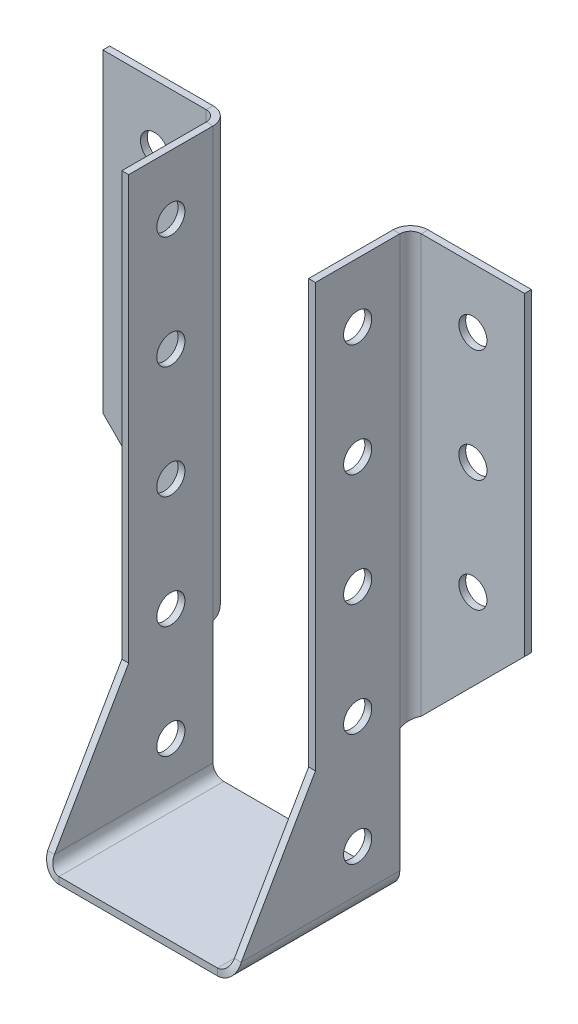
ISO-10303-21;
HEADER;
FILE_DESCRIPTION(('STEP AP214'),'2;1');
FILE_NAME('part.step','',(''),(''),'','','');
FILE_SCHEMA(('AUTOMOTIVE_DESIGN { 1 0 10303 214 1 1 1 1 }'));
ENDSEC;
DATA;
#1=APPLICATION_CONTEXT('core data for automotive mechanical design processes');
#2=APPLICATION_PROTOCOL_DEFINITION('international standard','automotive_design',2000,#1);
#3=PRODUCT_CONTEXT('',#1,'mechanical');
#4=PRODUCT('Part','Part','',(#3));
#5=PRODUCT_RELATED_PRODUCT_CATEGORY('part','',(#4));
#6=PRODUCT_DEFINITION_FORMATION('','',#4);
#7=PRODUCT_DEFINITION_CONTEXT('part definition',#1,'design');
#8=PRODUCT_DEFINITION('design','',#6,#7);
#9=PRODUCT_DEFINITION_SHAPE('','',#8);
#10=(LENGTH_UNIT() NAMED_UNIT(*) SI_UNIT(.MILLI.,.METRE.));
#11=(NAMED_UNIT(*) PLANE_ANGLE_UNIT() SI_UNIT($,.RADIAN.));
#12=(NAMED_UNIT(*) SI_UNIT($,.STERADIAN.) SOLID_ANGLE_UNIT());
#13=UNCERTAINTY_MEASURE_WITH_UNIT(LENGTH_MEASURE(1.E-05),#10,'distance_accuracy_value','');
#14=(GEOMETRIC_REPRESENTATION_CONTEXT(3) GLOBAL_UNCERTAINTY_ASSIGNED_CONTEXT((#13)) GLOBAL_UNIT_ASSIGNED_CONTEXT((#10,
#11,#12)) REPRESENTATION_CONTEXT('',''));
#15=CARTESIAN_POINT('',(0.,0.,0.));
#16=DIRECTION('',(0.,0.,1.));
#17=DIRECTION('',(1.,0.,0.));
#18=AXIS2_PLACEMENT_3D('',#15,#16,#17);
#19=CARTESIAN_POINT('',(-16.,100.,30.));
#20=DIRECTION('',(-1.,0.,0.));
#21=DIRECTION('',(0.,0.,1.));
#22=AXIS2_PLACEMENT_3D('',#19,#20,#21);
#23=PLANE('',#22);
#24=CARTESIAN_POINT('',(-16.,49.39294,7.49999999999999));
#25=DIRECTION('',(-1.,0.,0.));
#26=DIRECTION('',(0.,0.,1.));
#27=AXIS2_PLACEMENT_3D('',#24,#25,#26);
#28=CIRCLE('',#27,2.49999999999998);
#29=CARTESIAN_POINT('',(-16.,49.39294,9.99999999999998));
#30=VERTEX_POINT('',#29);
#31=EDGE_CURVE('E1303',#30,#30,#28,.T.);
#32=ORIENTED_EDGE('',*,*,#31,.T.);
#33=EDGE_LOOP('',(#32));
#34=FACE_BOUND('',#33,.T.);
#35=CARTESIAN_POINT('',(-16.,89.39294,7.5));
#36=DIRECTION('',(-1.,0.,0.));
#37=DIRECTION('',(0.,0.,1.));
#38=AXIS2_PLACEMENT_3D('',#35,#36,#37);
#39=CIRCLE('',#38,2.49999999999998);
#40=CARTESIAN_POINT('',(-16.,89.39294,9.99999999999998));
#41=VERTEX_POINT('',#40);
#42=EDGE_CURVE('E1291',#41,#41,#39,.T.);
#43=ORIENTED_EDGE('',*,*,#42,.T.);
#44=EDGE_LOOP('',(#43));
#45=FACE_BOUND('',#44,.T.);
#46=CARTESIAN_POINT('',(-16.,69.39294,7.5));
#47=DIRECTION('',(-1.,0.,0.));
#48=DIRECTION('',(0.,0.,1.));
#49=AXIS2_PLACEMENT_3D('',#46,#47,#48);
#50=CIRCLE('',#49,2.49999999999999);
#51=CARTESIAN_POINT('',(-16.,69.39294,9.99999999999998));
#52=VERTEX_POINT('',#51);
#53=EDGE_CURVE('E306',#52,#52,#50,.T.);
#54=ORIENTED_EDGE('',*,*,#53,.T.);
#55=EDGE_LOOP('',(#54));
#56=FACE_BOUND('',#55,.T.);
#57=CARTESIAN_POINT('',(-16.,9.39294,7.5));
#58=DIRECTION('',(-1.,0.,0.));
#59=DIRECTION('',(0.,0.,1.));
#60=AXIS2_PLACEMENT_3D('',#57,#58,#59);
#61=CIRCLE('',#60,2.49999999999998);
#62=CARTESIAN_POINT('',(-16.,9.39294,9.99999999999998));
#63=VERTEX_POINT('',#62);
#64=EDGE_CURVE('E303',#63,#63,#61,.T.);
#65=ORIENTED_EDGE('',*,*,#64,.T.);
#66=EDGE_LOOP('',(#65));
#67=FACE_BOUND('',#66,.T.);
#68=CARTESIAN_POINT('',(-16.,29.39294,7.5));
#69=DIRECTION('',(-1.,0.,0.));
#70=DIRECTION('',(0.,0.,1.));
#71=AXIS2_PLACEMENT_3D('',#68,#69,#70);
#72=CIRCLE('',#71,2.49999999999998);
#73=CARTESIAN_POINT('',(-16.,29.39294,9.99999999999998));
#74=VERTEX_POINT('',#73);
#75=EDGE_CURVE('E321',#74,#74,#72,.T.);
#76=ORIENTED_EDGE('',*,*,#75,.T.);
#77=EDGE_LOOP('',(#76));
#78=FACE_BOUND('',#77,.T.);
#79=DIRECTION('',(0.,-0.866025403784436,0.500000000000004));
#80=VECTOR('',#79,1.);
#81=CARTESIAN_POINT('',(-16.,74.6964699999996,-13.8269995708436));
#82=LINE('',#81,#80);
#83=CARTESIAN_POINT('',(-16.,24.7666421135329,15.));
#84=VERTEX_POINT('',#83);
#85=CARTESIAN_POINT('',(-16.,1.905,28.1991752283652));
#86=VERTEX_POINT('',#85);
#87=EDGE_CURVE('E358',#84,#86,#82,.T.);
#88=ORIENTED_EDGE('',*,*,#87,.T.);
#89=DIRECTION('',(0.,0.,-1.));
#90=VECTOR('',#89,1.);
#91=CARTESIAN_POINT('',(-16.,1.905,30.));
#92=LINE('',#91,#90);
#93=CARTESIAN_POINT('',(-16.,1.905,0.));
#94=VERTEX_POINT('',#93);
#95=EDGE_CURVE('E525',#86,#94,#92,.T.);
#96=ORIENTED_EDGE('',*,*,#95,.T.);
#97=DIRECTION('',(0.,1.,0.));
#98=VECTOR('',#97,1.);
#99=CARTESIAN_POINT('',(-16.,100.,0.));
#100=LINE('',#99,#98);
#101=CARTESIAN_POINT('',(-16.,23.78588,0.));
#102=VERTEX_POINT('',#101);
#103=EDGE_CURVE('E497',#94,#102,#100,.T.);
#104=ORIENTED_EDGE('',*,*,#103,.T.);
#105=DIRECTION('',(0.,-1.,0.));
#106=VECTOR('',#105,1.);
#107=CARTESIAN_POINT('',(-16.,23.78588,0.));
#108=LINE('',#107,#106);
#109=CARTESIAN_POINT('',(-16.,100.,0.));
#110=VERTEX_POINT('',#109);
#111=EDGE_CURVE('E400',#102,#110,#108,.F.);
#112=ORIENTED_EDGE('',*,*,#111,.T.);
#113=DIRECTION('',(0.,0.,-1.));
#114=VECTOR('',#113,1.);
#115=CARTESIAN_POINT('',(-16.,100.,30.));
#116=LINE('',#115,#114);
#117=CARTESIAN_POINT('',(-16.,100.,15.));
#118=VERTEX_POINT('',#117);
#119=EDGE_CURVE('E277',#118,#110,#116,.T.);
#120=ORIENTED_EDGE('',*,*,#119,.F.);
#121=DIRECTION('',(0.,-1.,0.));
#122=VECTOR('',#121,1.);
#123=CARTESIAN_POINT('',(-16.,100.,15.));
#124=LINE('',#123,#122);
#125=EDGE_CURVE('E348',#118,#84,#124,.T.);
#126=ORIENTED_EDGE('',*,*,#125,.T.);
#127=EDGE_LOOP('',(#88,#96,#104,#112,#120,#126));
#128=FACE_BOUND('',#127,.T.);
#129=ADVANCED_FACE('F76',(#34,#45,#56,#67,#78,#128),#23,.F.);
#130=CARTESIAN_POINT('',(-17.21412,100.,30.));
#131=DIRECTION('',(0.,1.,0.));
#132=DIRECTION('',(0.,0.,1.));
#133=AXIS2_PLACEMENT_3D('',#130,#131,#132);
#134=PLANE('',#133);
#135=DIRECTION('',(0.,0.,-1.));
#136=VECTOR('',#135,1.);
#137=CARTESIAN_POINT('',(-17.21412,100.,30.));
#138=LINE('',#137,#136);
#139=CARTESIAN_POINT('',(-17.21412,100.,15.));
#140=VERTEX_POINT('',#139);
#141=CARTESIAN_POINT('',(-17.21412,100.,0.));
#142=VERTEX_POINT('',#141);
#143=EDGE_CURVE('E275',#140,#142,#138,.T.);
#144=ORIENTED_EDGE('',*,*,#143,.F.);
#145=DIRECTION('',(1.,0.,0.));
#146=VECTOR('',#145,1.);
#147=CARTESIAN_POINT('',(-16.,100.,15.));
#148=LINE('',#147,#146);
#149=EDGE_CURVE('E250',#118,#140,#148,.F.);
#150=ORIENTED_EDGE('',*,*,#149,.F.);
#151=ORIENTED_EDGE('',*,*,#119,.T.);
#152=DIRECTION('',(1.,0.,0.));
#153=VECTOR('',#152,1.);
#154=CARTESIAN_POINT('',(-17.21412,100.,0.));
#155=LINE('',#154,#153);
#156=EDGE_CURVE('E492',#142,#110,#155,.T.);
#157=ORIENTED_EDGE('',*,*,#156,.F.);
#158=EDGE_LOOP('',(#144,#150,#151,#157));
#159=FACE_BOUND('',#158,.T.);
#160=ADVANCED_FACE('F454',(#159),#134,.T.);
#161=CARTESIAN_POINT('',(-17.21412,100.,30.));
#162=DIRECTION('',(-1.,0.,0.));
#163=DIRECTION('',(0.,0.,1.));
#164=AXIS2_PLACEMENT_3D('',#161,#162,#163);
#165=PLANE('',#164);
#166=CARTESIAN_POINT('',(-17.21412,49.39294,7.49999999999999));
#167=DIRECTION('',(-1.,0.,0.));
#168=DIRECTION('',(0.,0.,1.));
#169=AXIS2_PLACEMENT_3D('',#166,#167,#168);
#170=CIRCLE('',#169,2.49999999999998);
#171=CARTESIAN_POINT('',(-17.21412,49.39294,9.99999999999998));
#172=VERTEX_POINT('',#171);
#173=EDGE_CURVE('E1305',#172,#172,#170,.T.);
#174=ORIENTED_EDGE('',*,*,#173,.F.);
#175=EDGE_LOOP('',(#174));
#176=FACE_BOUND('',#175,.T.);
#177=CARTESIAN_POINT('',(-17.21412,89.39294,7.5));
#178=DIRECTION('',(-1.,0.,0.));
#179=DIRECTION('',(0.,0.,1.));
#180=AXIS2_PLACEMENT_3D('',#177,#178,#179);
#181=CIRCLE('',#180,2.49999999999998);
#182=CARTESIAN_POINT('',(-17.21412,89.39294,9.99999999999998));
#183=VERTEX_POINT('',#182);
#184=EDGE_CURVE('E1296',#183,#183,#181,.T.);
#185=ORIENTED_EDGE('',*,*,#184,.F.);
#186=EDGE_LOOP('',(#185));
#187=FACE_BOUND('',#186,.T.);
#188=CARTESIAN_POINT('',(-17.21412,69.39294,7.5));
#189=DIRECTION('',(-1.,0.,0.));
#190=DIRECTION('',(0.,0.,1.));
#191=AXIS2_PLACEMENT_3D('',#188,#189,#190);
#192=CIRCLE('',#191,2.49999999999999);
#193=CARTESIAN_POINT('',(-17.21412,69.39294,9.99999999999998));
#194=VERTEX_POINT('',#193);
#195=EDGE_CURVE('E311',#194,#194,#192,.T.);
#196=ORIENTED_EDGE('',*,*,#195,.F.);
#197=EDGE_LOOP('',(#196));
#198=FACE_BOUND('',#197,.T.);
#199=CARTESIAN_POINT('',(-17.21412,9.39294,7.5));
#200=DIRECTION('',(-1.,0.,0.));
#201=DIRECTION('',(0.,0.,1.));
#202=AXIS2_PLACEMENT_3D('',#199,#200,#201);
#203=CIRCLE('',#202,2.49999999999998);
#204=CARTESIAN_POINT('',(-17.21412,9.39294,9.99999999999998));
#205=VERTEX_POINT('',#204);
#206=EDGE_CURVE('E298',#205,#205,#203,.T.);
#207=ORIENTED_EDGE('',*,*,#206,.F.);
#208=EDGE_LOOP('',(#207));
#209=FACE_BOUND('',#208,.T.);
#210=CARTESIAN_POINT('',(-17.21412,29.39294,7.5));
#211=DIRECTION('',(-1.,0.,0.));
#212=DIRECTION('',(0.,0.,1.));
#213=AXIS2_PLACEMENT_3D('',#210,#211,#212);
#214=CIRCLE('',#213,2.49999999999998);
#215=CARTESIAN_POINT('',(-17.21412,29.39294,9.99999999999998));
#216=VERTEX_POINT('',#215);
#217=EDGE_CURVE('E294',#216,#216,#214,.T.);
#218=ORIENTED_EDGE('',*,*,#217,.F.);
#219=EDGE_LOOP('',(#218));
#220=FACE_BOUND('',#219,.T.);
#221=DIRECTION('',(0.,0.,-1.));
#222=VECTOR('',#221,1.);
#223=CARTESIAN_POINT('',(-17.21412,1.90500000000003,30.));
#224=LINE('',#223,#222);
#225=CARTESIAN_POINT('',(-17.21412,1.90500000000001,28.1991752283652));
#226=VERTEX_POINT('',#225);
#227=CARTESIAN_POINT('',(-17.21412,1.90500000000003,0.));
#228=VERTEX_POINT('',#227);
#229=EDGE_CURVE('E266',#226,#228,#224,.T.);
#230=ORIENTED_EDGE('',*,*,#229,.F.);
#231=DIRECTION('',(0.,-0.866025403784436,0.500000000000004));
#232=VECTOR('',#231,1.);
#233=CARTESIAN_POINT('',(-17.21412,74.6964699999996,-13.8269995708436));
#234=LINE('',#233,#232);
#235=CARTESIAN_POINT('',(-17.21412,24.7666421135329,15.));
#236=VERTEX_POINT('',#235);
#237=EDGE_CURVE('E240',#236,#226,#234,.T.);
#238=ORIENTED_EDGE('',*,*,#237,.F.);
#239=DIRECTION('',(0.,1.,0.));
#240=VECTOR('',#239,1.);
#241=CARTESIAN_POINT('',(-17.21412,100.,15.));
#242=LINE('',#241,#240);
#243=EDGE_CURVE('E251',#140,#236,#242,.F.);
#244=ORIENTED_EDGE('',*,*,#243,.F.);
#245=ORIENTED_EDGE('',*,*,#143,.T.);
#246=DIRECTION('',(0.,-1.,0.));
#247=VECTOR('',#246,1.);
#248=CARTESIAN_POINT('',(-17.21412,23.78588,0.));
#249=LINE('',#248,#247);
#250=CARTESIAN_POINT('',(-17.21412,23.78588,0.));
#251=VERTEX_POINT('',#250);
#252=EDGE_CURVE('E404',#251,#142,#249,.F.);
#253=ORIENTED_EDGE('',*,*,#252,.F.);
#254=DIRECTION('',(0.,1.,0.));
#255=VECTOR('',#254,1.);
#256=CARTESIAN_POINT('',(-17.21412,100.,0.));
#257=LINE('',#256,#255);
#258=EDGE_CURVE('E273',#228,#251,#257,.T.);
#259=ORIENTED_EDGE('',*,*,#258,.F.);
#260=EDGE_LOOP('',(#230,#238,#244,#245,#253,#259));
#261=FACE_BOUND('',#260,.T.);
#262=ADVANCED_FACE('F270',(#176,#187,#198,#209,#220,#261),#165,.T.);
#263=CARTESIAN_POINT('',(-14.095,1.905,30.));
#264=DIRECTION('',(0.,0.,-1.));
#265=DIRECTION('',(-1.,0.,0.));
#266=AXIS2_PLACEMENT_3D('',#263,#264,#265);
#267=CYLINDRICAL_SURFACE('',#266,3.11912);
#268=DIRECTION('',(0.,0.,-1.));
#269=VECTOR('',#268,1.);
#270=CARTESIAN_POINT('',(-14.095,-1.21412,30.));
#271=LINE('',#270,#269);
#272=CARTESIAN_POINT('',(-14.095,-1.21412,29.2990274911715));
#273=VERTEX_POINT('',#272);
#274=CARTESIAN_POINT('',(-14.095,-1.21412,0.));
#275=VERTEX_POINT('',#274);
#276=EDGE_CURVE('E267',#273,#275,#271,.T.);
#277=ORIENTED_EDGE('',*,*,#276,.F.);
#278=CARTESIAN_POINT('',(-14.095,1.905,28.1991752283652));
#279=DIRECTION('',(0.,-0.332547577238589,-0.943086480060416));
#280=DIRECTION('',(0.,0.943086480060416,-0.332547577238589));
#281=AXIS2_PLACEMENT_3D('',#278,#279,#280);
#282=ELLIPSE('',#281,3.30735310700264,3.11912);
#283=EDGE_CURVE('E256',#226,#273,#282,.F.);
#284=ORIENTED_EDGE('',*,*,#283,.F.);
#285=ORIENTED_EDGE('',*,*,#229,.T.);
#286=CARTESIAN_POINT('',(-14.095,1.905,0.));
#287=DIRECTION('',(0.,0.,1.));
#288=DIRECTION('',(1.,0.,0.));
#289=AXIS2_PLACEMENT_3D('',#286,#287,#288);
#290=CIRCLE('',#289,3.11912);
#291=EDGE_CURVE('E491',#275,#228,#290,.F.);
#292=ORIENTED_EDGE('',*,*,#291,.F.);
#293=EDGE_LOOP('',(#277,#284,#285,#292));
#294=FACE_BOUND('',#293,.T.);
#295=ADVANCED_FACE('F264',(#294),#267,.T.);
#296=CARTESIAN_POINT('',(-16.,-1.21412,30.));
#297=DIRECTION('',(0.,-1.,0.));
#298=DIRECTION('',(0.,0.,-1.));
#299=AXIS2_PLACEMENT_3D('',#296,#297,#298);
#300=PLANE('',#299);
#301=DIRECTION('',(0.,0.,-1.));
#302=VECTOR('',#301,1.);
#303=CARTESIAN_POINT('',(14.095,-1.21412,30.));
#304=LINE('',#303,#302);
#305=CARTESIAN_POINT('',(14.095,-1.21412,29.2990274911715));
#306=VERTEX_POINT('',#305);
#307=CARTESIAN_POINT('',(14.095,-1.21412,0.));
#308=VERTEX_POINT('',#307);
#309=EDGE_CURVE('E279',#306,#308,#304,.T.);
#310=ORIENTED_EDGE('',*,*,#309,.F.);
#311=DIRECTION('',(1.,0.,0.));
#312=VECTOR('',#311,1.);
#313=CARTESIAN_POINT('',(-16.,-1.21412,29.2990274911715));
#314=LINE('',#313,#312);
#315=EDGE_CURVE('E351',#273,#306,#314,.T.);
#316=ORIENTED_EDGE('',*,*,#315,.F.);
#317=ORIENTED_EDGE('',*,*,#276,.T.);
#318=DIRECTION('',(1.,0.,0.));
#319=VECTOR('',#318,1.);
#320=CARTESIAN_POINT('',(-16.,-1.21412,0.));
#321=LINE('',#320,#319);
#322=EDGE_CURVE('E494',#308,#275,#321,.F.);
#323=ORIENTED_EDGE('',*,*,#322,.F.);
#324=EDGE_LOOP('',(#310,#316,#317,#323));
#325=FACE_BOUND('',#324,.T.);
#326=ADVANCED_FACE('F550',(#325),#300,.T.);
#327=CARTESIAN_POINT('',(14.095,1.905,30.));
#328=DIRECTION('',(0.,0.,-1.));
#329=DIRECTION('',(-1.,0.,0.));
#330=AXIS2_PLACEMENT_3D('',#327,#328,#329);
#331=CYLINDRICAL_SURFACE('',#330,3.11912);
#332=DIRECTION('',(0.,0.,-1.));
#333=VECTOR('',#332,1.);
#334=CARTESIAN_POINT('',(17.21412,1.90500000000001,30.));
#335=LINE('',#334,#333);
#336=CARTESIAN_POINT('',(17.21412,1.905,28.1991752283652));
#337=VERTEX_POINT('',#336);
#338=CARTESIAN_POINT('',(17.21412,1.90500000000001,0.));
#339=VERTEX_POINT('',#338);
#340=EDGE_CURVE('E537',#337,#339,#335,.T.);
#341=ORIENTED_EDGE('',*,*,#340,.F.);
#342=CARTESIAN_POINT('',(14.095,1.905,28.1991752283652));
#343=DIRECTION('',(0.,-0.332547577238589,-0.943086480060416));
#344=DIRECTION('',(0.,0.943086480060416,-0.332547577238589));
#345=AXIS2_PLACEMENT_3D('',#342,#343,#344);
#346=ELLIPSE('',#345,3.30735310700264,3.11912);
#347=EDGE_CURVE('E326',#306,#337,#346,.F.);
#348=ORIENTED_EDGE('',*,*,#347,.F.);
#349=ORIENTED_EDGE('',*,*,#309,.T.);
#350=CARTESIAN_POINT('',(14.095,1.905,0.));
#351=DIRECTION('',(0.,0.,1.));
#352=DIRECTION('',(1.,0.,0.));
#353=AXIS2_PLACEMENT_3D('',#350,#351,#352);
#354=CIRCLE('',#353,3.11912);
#355=EDGE_CURVE('E503',#339,#308,#354,.F.);
#356=ORIENTED_EDGE('',*,*,#355,.F.);
#357=EDGE_LOOP('',(#341,#348,#349,#356));
#358=FACE_BOUND('',#357,.T.);
#359=ADVANCED_FACE('F543',(#358),#331,.T.);
#360=CARTESIAN_POINT('',(17.21412,100.,30.));
#361=DIRECTION('',(1.,0.,0.));
#362=DIRECTION('',(0.,0.,-1.));
#363=AXIS2_PLACEMENT_3D('',#360,#361,#362);
#364=PLANE('',#363);
#365=CARTESIAN_POINT('',(17.21412,49.39294,7.49999999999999));
#366=DIRECTION('',(1.,0.,0.));
#367=DIRECTION('',(0.,0.,-1.));
#368=AXIS2_PLACEMENT_3D('',#365,#366,#367);
#369=CIRCLE('',#368,2.49999999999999);
#370=CARTESIAN_POINT('',(17.21412,49.39294,5.00000000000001));
#371=VERTEX_POINT('',#370);
#372=EDGE_CURVE('E1308',#371,#371,#369,.T.);
#373=ORIENTED_EDGE('',*,*,#372,.F.);
#374=EDGE_LOOP('',(#373));
#375=FACE_BOUND('',#374,.T.);
#376=CARTESIAN_POINT('',(17.21412,89.39294,7.5));
#377=DIRECTION('',(1.,0.,0.));
#378=DIRECTION('',(0.,0.,-1.));
#379=AXIS2_PLACEMENT_3D('',#376,#377,#378);
#380=CIRCLE('',#379,2.49999999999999);
#381=CARTESIAN_POINT('',(17.21412,89.39294,5.00000000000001));
#382=VERTEX_POINT('',#381);
#383=EDGE_CURVE('E1300',#382,#382,#380,.T.);
#384=ORIENTED_EDGE('',*,*,#383,.F.);
#385=EDGE_LOOP('',(#384));
#386=FACE_BOUND('',#385,.T.);
#387=CARTESIAN_POINT('',(17.21412,69.39294,7.5));
#388=DIRECTION('',(1.,0.,0.));
#389=DIRECTION('',(0.,0.,-1.));
#390=AXIS2_PLACEMENT_3D('',#387,#388,#389);
#391=CIRCLE('',#390,2.49999999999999);
#392=CARTESIAN_POINT('',(17.21412,69.39294,5.00000000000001));
#393=VERTEX_POINT('',#392);
#394=EDGE_CURVE('E1287',#393,#393,#391,.T.);
#395=ORIENTED_EDGE('',*,*,#394,.F.);
#396=EDGE_LOOP('',(#395));
#397=FACE_BOUND('',#396,.T.);
#398=CARTESIAN_POINT('',(17.21412,9.39294,7.5));
#399=DIRECTION('',(1.,0.,0.));
#400=DIRECTION('',(0.,0.,-1.));
#401=AXIS2_PLACEMENT_3D('',#398,#399,#400);
#402=CIRCLE('',#401,2.49999999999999);
#403=CARTESIAN_POINT('',(17.21412,9.39294,5.00000000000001));
#404=VERTEX_POINT('',#403);
#405=EDGE_CURVE('E299',#404,#404,#402,.T.);
#406=ORIENTED_EDGE('',*,*,#405,.F.);
#407=EDGE_LOOP('',(#406));
#408=FACE_BOUND('',#407,.T.);
#409=CARTESIAN_POINT('',(17.21412,29.39294,7.5));
#410=DIRECTION('',(1.,0.,0.));
#411=DIRECTION('',(0.,0.,-1.));
#412=AXIS2_PLACEMENT_3D('',#409,#410,#411);
#413=CIRCLE('',#412,2.49999999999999);
#414=CARTESIAN_POINT('',(17.21412,29.39294,5.00000000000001));
#415=VERTEX_POINT('',#414);
#416=EDGE_CURVE('E295',#415,#415,#413,.T.);
#417=ORIENTED_EDGE('',*,*,#416,.F.);
#418=EDGE_LOOP('',(#417));
#419=FACE_BOUND('',#418,.T.);
#420=DIRECTION('',(0.,0.,-1.));
#421=VECTOR('',#420,1.);
#422=CARTESIAN_POINT('',(17.21412,100.,30.));
#423=LINE('',#422,#421);
#424=CARTESIAN_POINT('',(17.21412,100.,15.));
#425=VERTEX_POINT('',#424);
#426=CARTESIAN_POINT('',(17.21412,100.,0.));
#427=VERTEX_POINT('',#426);
#428=EDGE_CURVE('E535',#425,#427,#423,.T.);
#429=ORIENTED_EDGE('',*,*,#428,.F.);
#430=DIRECTION('',(0.,1.,0.));
#431=VECTOR('',#430,1.);
#432=CARTESIAN_POINT('',(17.21412,100.,15.));
#433=LINE('',#432,#431);
#434=CARTESIAN_POINT('',(17.21412,24.7666421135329,15.));
#435=VERTEX_POINT('',#434);
#436=EDGE_CURVE('E330',#435,#425,#433,.T.);
#437=ORIENTED_EDGE('',*,*,#436,.F.);
#438=DIRECTION('',(0.,0.866025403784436,-0.500000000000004));
#439=VECTOR('',#438,1.);
#440=CARTESIAN_POINT('',(17.21412,74.6964699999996,-13.8269995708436));
#441=LINE('',#440,#439);
#442=EDGE_CURVE('E332',#337,#435,#441,.T.);
#443=ORIENTED_EDGE('',*,*,#442,.F.);
#444=ORIENTED_EDGE('',*,*,#340,.T.);
#445=DIRECTION('',(0.,1.,0.));
#446=VECTOR('',#445,1.);
#447=CARTESIAN_POINT('',(17.21412,100.,0.));
#448=LINE('',#447,#446);
#449=CARTESIAN_POINT('',(17.21412,23.78588,0.));
#450=VERTEX_POINT('',#449);
#451=EDGE_CURVE('E506',#450,#339,#448,.F.);
#452=ORIENTED_EDGE('',*,*,#451,.F.);
#453=EDGE_CURVE('E507',#427,#450,#448,.F.);
#454=ORIENTED_EDGE('',*,*,#453,.F.);
#455=EDGE_LOOP('',(#429,#437,#443,#444,#452,#454));
#456=FACE_BOUND('',#455,.T.);
#457=ADVANCED_FACE('F562',(#375,#386,#397,#408,#419,#456),#364,.T.);
#458=CARTESIAN_POINT('',(16.,100.,30.));
#459=DIRECTION('',(0.,1.,0.));
#460=DIRECTION('',(0.,0.,1.));
#461=AXIS2_PLACEMENT_3D('',#458,#459,#460);
#462=PLANE('',#461);
#463=DIRECTION('',(0.,0.,-1.));
#464=VECTOR('',#463,1.);
#465=CARTESIAN_POINT('',(16.,100.,30.));
#466=LINE('',#465,#464);
#467=CARTESIAN_POINT('',(16.,100.,15.));
#468=VERTEX_POINT('',#467);
#469=CARTESIAN_POINT('',(16.,100.,0.));
#470=VERTEX_POINT('',#469);
#471=EDGE_CURVE('E533',#468,#470,#466,.T.);
#472=ORIENTED_EDGE('',*,*,#471,.F.);
#473=DIRECTION('',(-1.,0.,0.));
#474=VECTOR('',#473,1.);
#475=CARTESIAN_POINT('',(16.,100.,15.));
#476=LINE('',#475,#474);
#477=EDGE_CURVE('E342',#468,#425,#476,.F.);
#478=ORIENTED_EDGE('',*,*,#477,.T.);
#479=ORIENTED_EDGE('',*,*,#428,.T.);
#480=DIRECTION('',(1.,0.,0.));
#481=VECTOR('',#480,1.);
#482=CARTESIAN_POINT('',(16.,100.,0.));
#483=LINE('',#482,#481);
#484=EDGE_CURVE('E510',#470,#427,#483,.T.);
#485=ORIENTED_EDGE('',*,*,#484,.F.);
#486=EDGE_LOOP('',(#472,#478,#479,#485));
#487=FACE_BOUND('',#486,.T.);
#488=ADVANCED_FACE('F676',(#487),#462,.T.);
#489=CARTESIAN_POINT('',(16.,100.,30.));
#490=DIRECTION('',(1.,0.,0.));
#491=DIRECTION('',(0.,0.,-1.));
#492=AXIS2_PLACEMENT_3D('',#489,#490,#491);
#493=PLANE('',#492);
#494=CARTESIAN_POINT('',(16.,49.39294,7.49999999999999));
#495=DIRECTION('',(1.,0.,0.));
#496=DIRECTION('',(0.,0.,-1.));
#497=AXIS2_PLACEMENT_3D('',#494,#495,#496);
#498=CIRCLE('',#497,2.49999999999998);
#499=CARTESIAN_POINT('',(16.,49.39294,5.00000000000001));
#500=VERTEX_POINT('',#499);
#501=EDGE_CURVE('E80',#500,#500,#498,.T.);
#502=ORIENTED_EDGE('',*,*,#501,.T.);
#503=EDGE_LOOP('',(#502));
#504=FACE_BOUND('',#503,.T.);
#505=CARTESIAN_POINT('',(16.,89.39294,7.5));
#506=DIRECTION('',(1.,0.,0.));
#507=DIRECTION('',(0.,0.,-1.));
#508=AXIS2_PLACEMENT_3D('',#505,#506,#507);
#509=CIRCLE('',#508,2.49999999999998);
#510=CARTESIAN_POINT('',(16.,89.39294,5.00000000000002));
#511=VERTEX_POINT('',#510);
#512=EDGE_CURVE('E1279',#511,#511,#509,.T.);
#513=ORIENTED_EDGE('',*,*,#512,.T.);
#514=EDGE_LOOP('',(#513));
#515=FACE_BOUND('',#514,.T.);
#516=CARTESIAN_POINT('',(16.,69.39294,7.5));
#517=DIRECTION('',(1.,0.,0.));
#518=DIRECTION('',(0.,0.,-1.));
#519=AXIS2_PLACEMENT_3D('',#516,#517,#518);
#520=CIRCLE('',#519,2.49999999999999);
#521=CARTESIAN_POINT('',(16.,69.39294,5.00000000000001));
#522=VERTEX_POINT('',#521);
#523=EDGE_CURVE('E1282',#522,#522,#520,.T.);
#524=ORIENTED_EDGE('',*,*,#523,.T.);
#525=EDGE_LOOP('',(#524));
#526=FACE_BOUND('',#525,.T.);
#527=CARTESIAN_POINT('',(16.,9.39294,7.5));
#528=DIRECTION('',(1.,0.,0.));
#529=DIRECTION('',(0.,0.,-1.));
#530=AXIS2_PLACEMENT_3D('',#527,#528,#529);
#531=CIRCLE('',#530,2.49999999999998);
#532=CARTESIAN_POINT('',(16.,9.39294,5.00000000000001));
#533=VERTEX_POINT('',#532);
#534=EDGE_CURVE('E296',#533,#533,#531,.T.);
#535=ORIENTED_EDGE('',*,*,#534,.T.);
#536=EDGE_LOOP('',(#535));
#537=FACE_BOUND('',#536,.T.);
#538=CARTESIAN_POINT('',(16.,29.39294,7.5));
#539=DIRECTION('',(1.,0.,0.));
#540=DIRECTION('',(0.,0.,-1.));
#541=AXIS2_PLACEMENT_3D('',#538,#539,#540);
#542=CIRCLE('',#541,2.49999999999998);
#543=CARTESIAN_POINT('',(16.,29.39294,5.00000000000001));
#544=VERTEX_POINT('',#543);
#545=EDGE_CURVE('E292',#544,#544,#542,.T.);
#546=ORIENTED_EDGE('',*,*,#545,.T.);
#547=EDGE_LOOP('',(#546));
#548=FACE_BOUND('',#547,.T.);
#549=DIRECTION('',(0.,1.,0.));
#550=VECTOR('',#549,1.);
#551=CARTESIAN_POINT('',(16.,100.,15.));
#552=LINE('',#551,#550);
#553=CARTESIAN_POINT('',(16.,24.7666421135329,15.));
#554=VERTEX_POINT('',#553);
#555=EDGE_CURVE('E336',#554,#468,#552,.T.);
#556=ORIENTED_EDGE('',*,*,#555,.T.);
#557=ORIENTED_EDGE('',*,*,#471,.T.);
#558=DIRECTION('',(0.,-1.,0.));
#559=VECTOR('',#558,1.);
#560=CARTESIAN_POINT('',(16.,100.,0.));
#561=LINE('',#560,#559);
#562=CARTESIAN_POINT('',(16.,23.78588,0.));
#563=VERTEX_POINT('',#562);
#564=EDGE_CURVE('E514',#470,#563,#561,.T.);
#565=ORIENTED_EDGE('',*,*,#564,.T.);
#566=CARTESIAN_POINT('',(16.,1.905,0.));
#567=VERTEX_POINT('',#566);
#568=EDGE_CURVE('E513',#563,#567,#561,.T.);
#569=ORIENTED_EDGE('',*,*,#568,.T.);
#570=DIRECTION('',(0.,0.,-1.));
#571=VECTOR('',#570,1.);
#572=CARTESIAN_POINT('',(16.,1.905,30.));
#573=LINE('',#572,#571);
#574=CARTESIAN_POINT('',(16.,1.905,28.1991752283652));
#575=VERTEX_POINT('',#574);
#576=EDGE_CURVE('E531',#575,#567,#573,.T.);
#577=ORIENTED_EDGE('',*,*,#576,.F.);
#578=DIRECTION('',(0.,0.866025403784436,-0.500000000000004));
#579=VECTOR('',#578,1.);
#580=CARTESIAN_POINT('',(16.,74.6964699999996,-13.8269995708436));
#581=LINE('',#580,#579);
#582=EDGE_CURVE('E333',#575,#554,#581,.T.);
#583=ORIENTED_EDGE('',*,*,#582,.T.);
#584=EDGE_LOOP('',(#556,#557,#565,#569,#577,#583));
#585=FACE_BOUND('',#584,.T.);
#586=ADVANCED_FACE('F678',(#504,#515,#526,#537,#548,#585),#493,.F.);
#587=CARTESIAN_POINT('',(14.095,1.905,30.));
#588=DIRECTION('',(0.,0.,-1.));
#589=DIRECTION('',(-1.,0.,0.));
#590=AXIS2_PLACEMENT_3D('',#587,#588,#589);
#591=CYLINDRICAL_SURFACE('',#590,1.905);
#592=CARTESIAN_POINT('',(14.095,1.905,28.1991752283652));
#593=DIRECTION('',(0.,-0.500000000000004,-0.866025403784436));
#594=DIRECTION('',(0.,0.866025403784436,-0.500000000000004));
#595=AXIS2_PLACEMENT_3D('',#592,#593,#594);
#596=ELLIPSE('',#595,2.19970452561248,1.905);
#597=CARTESIAN_POINT('',(14.095,0.,29.2990274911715));
#598=VERTEX_POINT('',#597);
#599=EDGE_CURVE('E323',#598,#575,#596,.F.);
#600=ORIENTED_EDGE('',*,*,#599,.T.);
#601=ORIENTED_EDGE('',*,*,#576,.T.);
#602=CARTESIAN_POINT('',(14.095,1.905,0.));
#603=DIRECTION('',(0.,0.,-1.));
#604=DIRECTION('',(-1.,0.,0.));
#605=AXIS2_PLACEMENT_3D('',#602,#603,#604);
#606=CIRCLE('',#605,1.905);
#607=CARTESIAN_POINT('',(14.095,0.,0.));
#608=VERTEX_POINT('',#607);
#609=EDGE_CURVE('E516',#567,#608,#606,.T.);
#610=ORIENTED_EDGE('',*,*,#609,.T.);
#611=DIRECTION('',(0.,0.,-1.));
#612=VECTOR('',#611,1.);
#613=CARTESIAN_POINT('',(14.095,0.,30.));
#614=LINE('',#613,#612);
#615=EDGE_CURVE('E529',#598,#608,#614,.T.);
#616=ORIENTED_EDGE('',*,*,#615,.F.);
#617=EDGE_LOOP('',(#600,#601,#610,#616));
#618=FACE_BOUND('',#617,.T.);
#619=ADVANCED_FACE('F1199',(#618),#591,.F.);
#620=CARTESIAN_POINT('',(-16.,0.,30.));
#621=DIRECTION('',(0.,-1.,0.));
#622=DIRECTION('',(0.,0.,-1.));
#623=AXIS2_PLACEMENT_3D('',#620,#621,#622);
#624=PLANE('',#623);
#625=DIRECTION('',(1.,0.,0.));
#626=VECTOR('',#625,1.);
#627=CARTESIAN_POINT('',(-16.,0.,29.2990274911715));
#628=LINE('',#627,#626);
#629=CARTESIAN_POINT('',(-14.095,0.,29.2990274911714));
#630=VERTEX_POINT('',#629);
#631=EDGE_CURVE('E93',#630,#598,#628,.T.);
#632=ORIENTED_EDGE('',*,*,#631,.T.);
#633=ORIENTED_EDGE('',*,*,#615,.T.);
#634=DIRECTION('',(-1.,0.,0.));
#635=VECTOR('',#634,1.);
#636=CARTESIAN_POINT('',(-16.,0.,0.));
#637=LINE('',#636,#635);
#638=CARTESIAN_POINT('',(-14.095,0.,0.));
#639=VERTEX_POINT('',#638);
#640=EDGE_CURVE('E519',#608,#639,#637,.T.);
#641=ORIENTED_EDGE('',*,*,#640,.T.);
#642=DIRECTION('',(0.,0.,-1.));
#643=VECTOR('',#642,1.);
#644=CARTESIAN_POINT('',(-14.095,0.,30.));
#645=LINE('',#644,#643);
#646=EDGE_CURVE('E527',#630,#639,#645,.T.);
#647=ORIENTED_EDGE('',*,*,#646,.F.);
#648=EDGE_LOOP('',(#632,#633,#641,#647));
#649=FACE_BOUND('',#648,.T.);
#650=ADVANCED_FACE('F485',(#649),#624,.F.);
#651=CARTESIAN_POINT('',(-14.095,1.905,30.));
#652=DIRECTION('',(0.,0.,-1.));
#653=DIRECTION('',(-1.,0.,0.));
#654=AXIS2_PLACEMENT_3D('',#651,#652,#653);
#655=CYLINDRICAL_SURFACE('',#654,1.905);
#656=CARTESIAN_POINT('',(-14.095,1.905,28.1991752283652));
#657=DIRECTION('',(0.,-0.500000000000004,-0.866025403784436));
#658=DIRECTION('',(0.,0.866025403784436,-0.500000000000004));
#659=AXIS2_PLACEMENT_3D('',#656,#657,#658);
#660=ELLIPSE('',#659,2.19970452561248,1.905);
#661=EDGE_CURVE('E258',#86,#630,#660,.F.);
#662=ORIENTED_EDGE('',*,*,#661,.T.);
#663=ORIENTED_EDGE('',*,*,#646,.T.);
#664=CARTESIAN_POINT('',(-14.095,1.905,0.));
#665=DIRECTION('',(0.,0.,-1.));
#666=DIRECTION('',(-1.,0.,0.));
#667=AXIS2_PLACEMENT_3D('',#664,#665,#666);
#668=CIRCLE('',#667,1.905);
#669=EDGE_CURVE('E522',#639,#94,#668,.T.);
#670=ORIENTED_EDGE('',*,*,#669,.T.);
#671=ORIENTED_EDGE('',*,*,#95,.F.);
#672=EDGE_LOOP('',(#662,#663,#670,#671));
#673=FACE_BOUND('',#672,.T.);
#674=ADVANCED_FACE('F477',(#673),#655,.F.);
#675=CARTESIAN_POINT('',(-14.095,-1.21412,0.));
#676=DIRECTION('',(0.,0.,-1.));
#677=DIRECTION('',(-1.,0.,0.));
#678=AXIS2_PLACEMENT_3D('',#675,#676,#677);
#679=PLANE('',#678);
#680=ORIENTED_EDGE('',*,*,#258,.T.);
#681=DIRECTION('',(1.,0.,0.));
#682=VECTOR('',#681,1.);
#683=CARTESIAN_POINT('',(-17.21412,23.78588,0.));
#684=LINE('',#683,#682);
#685=EDGE_CURVE('E399',#251,#102,#684,.T.);
#686=ORIENTED_EDGE('',*,*,#685,.T.);
#687=ORIENTED_EDGE('',*,*,#103,.F.);
#688=DIRECTION('',(-1.,0.,0.));
#689=VECTOR('',#688,1.);
#690=CARTESIAN_POINT('',(-16.,1.905,0.));
#691=LINE('',#690,#689);
#692=EDGE_CURVE('E13',#94,#228,#691,.T.);
#693=ORIENTED_EDGE('',*,*,#692,.T.);
#694=EDGE_LOOP('',(#680,#686,#687,#693));
#695=FACE_BOUND('',#694,.T.);
#696=ADVANCED_FACE('F474',(#695),#679,.T.);
#697=CARTESIAN_POINT('',(-14.095,1.905,0.));
#698=DIRECTION('',(0.,0.,1.));
#699=DIRECTION('',(1.,0.,0.));
#700=AXIS2_PLACEMENT_3D('',#697,#698,#699);
#701=PLANE('',#700);
#702=DIRECTION('',(-1.,0.,0.));
#703=VECTOR('',#702,1.);
#704=CARTESIAN_POINT('',(17.21412,23.78588,0.));
#705=LINE('',#704,#703);
#706=EDGE_CURVE('E558',#450,#563,#705,.T.);
#707=ORIENTED_EDGE('',*,*,#706,.F.);
#708=ORIENTED_EDGE('',*,*,#451,.T.);
#709=DIRECTION('',(-1.,0.,0.));
#710=VECTOR('',#709,1.);
#711=CARTESIAN_POINT('',(17.21412,1.90500000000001,0.));
#712=LINE('',#711,#710);
#713=EDGE_CURVE('E284',#339,#567,#712,.T.);
#714=ORIENTED_EDGE('',*,*,#713,.T.);
#715=ORIENTED_EDGE('',*,*,#568,.F.);
#716=EDGE_LOOP('',(#707,#708,#714,#715));
#717=FACE_BOUND('',#716,.T.);
#718=ADVANCED_FACE('F476',(#717),#701,.F.);
#719=CARTESIAN_POINT('',(-16.,1.905,0.));
#720=DIRECTION('',(0.,0.,-1.));
#721=DIRECTION('',(-1.,0.,0.));
#722=AXIS2_PLACEMENT_3D('',#719,#720,#721);
#723=PLANE('',#722);
#724=ORIENTED_EDGE('',*,*,#692,.F.);
#725=ORIENTED_EDGE('',*,*,#669,.F.);
#726=DIRECTION('',(0.,1.,0.));
#727=VECTOR('',#726,1.);
#728=CARTESIAN_POINT('',(-14.095,-1.21412,0.));
#729=LINE('',#728,#727);
#730=EDGE_CURVE('E85',#275,#639,#729,.T.);
#731=ORIENTED_EDGE('',*,*,#730,.F.);
#732=ORIENTED_EDGE('',*,*,#291,.T.);
#733=EDGE_LOOP('',(#724,#725,#731,#732));
#734=FACE_BOUND('',#733,.T.);
#735=ADVANCED_FACE('F78',(#734),#723,.T.);
#736=CARTESIAN_POINT('',(14.095,0.,0.));
#737=DIRECTION('',(0.,0.,-1.));
#738=DIRECTION('',(-1.,0.,0.));
#739=AXIS2_PLACEMENT_3D('',#736,#737,#738);
#740=PLANE('',#739);
#741=DIRECTION('',(0.,-1.,0.));
#742=VECTOR('',#741,1.);
#743=CARTESIAN_POINT('',(14.095,0.,0.));
#744=LINE('',#743,#742);
#745=EDGE_CURVE('E287',#608,#308,#744,.T.);
#746=ORIENTED_EDGE('',*,*,#745,.F.);
#747=ORIENTED_EDGE('',*,*,#609,.F.);
#748=ORIENTED_EDGE('',*,*,#713,.F.);
#749=ORIENTED_EDGE('',*,*,#355,.T.);
#750=EDGE_LOOP('',(#746,#747,#748,#749));
#751=FACE_BOUND('',#750,.T.);
#752=ADVANCED_FACE('F470',(#751),#740,.T.);
#753=CARTESIAN_POINT('',(17.21412,1.90500000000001,0.));
#754=DIRECTION('',(0.,0.,-1.));
#755=DIRECTION('',(-1.,0.,0.));
#756=AXIS2_PLACEMENT_3D('',#753,#754,#755);
#757=PLANE('',#756);
#758=ORIENTED_EDGE('',*,*,#640,.F.);
#759=ORIENTED_EDGE('',*,*,#745,.T.);
#760=ORIENTED_EDGE('',*,*,#322,.T.);
#761=ORIENTED_EDGE('',*,*,#730,.T.);
#762=EDGE_LOOP('',(#758,#759,#760,#761));
#763=FACE_BOUND('',#762,.T.);
#764=ADVANCED_FACE('F466',(#763),#757,.T.);
#765=CARTESIAN_POINT('',(15.9878588,23.78588,0.));
#766=CARTESIAN_POINT('',(15.9878588,23.9446549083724,-0.409945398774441));
#767=CARTESIAN_POINT('',(16.0693571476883,24.10338,-0.819600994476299));
#768=CARTESIAN_POINT('',(16.3830665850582,24.42088,-1.57696257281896));
#769=CARTESIAN_POINT('',(16.615154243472,24.57963,-1.92430629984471));
#770=CARTESIAN_POINT('',(17.1948137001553,24.89713,-2.50396575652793));
#771=CARTESIAN_POINT('',(17.542157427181,25.05588,-2.73605341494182));
#772=CARTESIAN_POINT('',(18.2995190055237,25.37338,-3.04976285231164));
#773=CARTESIAN_POINT('',(18.7091746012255,25.5321050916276,-3.1312612));
#774=CARTESIAN_POINT('',(19.11912,25.69088,-3.1312612));
#775=CARTESIAN_POINT('',(16.,23.78588,0.));
#776=CARTESIAN_POINT('',(16.,23.9446548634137,-0.408355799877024));
#777=CARTESIAN_POINT('',(16.0811823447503,24.10338,-0.816423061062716));
#778=CARTESIAN_POINT('',(16.3936754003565,24.42088,-1.57084803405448));
#779=CARTESIAN_POINT('',(16.624863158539,24.57963,-1.91684496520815));
#780=CARTESIAN_POINT('',(17.2022750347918,24.89713,-2.49425684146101));
#781=CARTESIAN_POINT('',(17.5482719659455,25.05588,-2.72544459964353));
#782=CARTESIAN_POINT('',(18.3026969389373,25.37338,-3.03793765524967));
#783=CARTESIAN_POINT('',(18.7107642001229,25.5321051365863,-3.11912));
#784=CARTESIAN_POINT('',(19.11912,25.69088,-3.11912));
#785=CARTESIAN_POINT('',(17.21412,23.78588,0.));
#786=CARTESIAN_POINT('',(17.21412,23.9446503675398,-0.249395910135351));
#787=CARTESIAN_POINT('',(17.2637020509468,24.10338,-0.498629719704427));
#788=CARTESIAN_POINT('',(17.4545569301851,24.42088,-0.959394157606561));
#789=CARTESIAN_POINT('',(17.5957546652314,24.57963,-1.17071150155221));
#790=CARTESIAN_POINT('',(17.9484084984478,24.89713,-1.52336533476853));
#791=CARTESIAN_POINT('',(18.1597258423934,25.05588,-1.66456306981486));
#792=CARTESIAN_POINT('',(18.6204902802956,25.37338,-1.85541794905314));
#793=CARTESIAN_POINT('',(18.8697240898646,25.5321096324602,-1.905));
#794=CARTESIAN_POINT('',(19.11912,25.69088,-1.905));
#795=CARTESIAN_POINT('',(17.226382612,23.78588,0.));
#796=CARTESIAN_POINT('',(17.226382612,23.9446503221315,-0.24779041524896));
#797=CARTESIAN_POINT('',(17.2756454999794,24.10338,-0.495420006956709));
#798=CARTESIAN_POINT('',(17.4652718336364,24.42088,-0.953218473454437));
#799=CARTESIAN_POINT('',(17.605560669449,24.57963,-1.16317555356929));
#800=CARTESIAN_POINT('',(17.9559444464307,24.89713,-1.51355933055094));
#801=CARTESIAN_POINT('',(18.1659015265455,25.05588,-1.65384816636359));
#802=CARTESIAN_POINT('',(18.6236999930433,25.37338,-1.84347450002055));
#803=CARTESIAN_POINT('',(18.871329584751,25.5321096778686,-1.892737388));
#804=CARTESIAN_POINT('',(19.11912,25.69088,-1.892737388));
#805=B_SPLINE_SURFACE_WITH_KNOTS('',1,3,((#765,#766,#767,#768,#769,#770,#771,#772,#773,#774),
(#775,#776,#777,#778,#779,#780,#781,#782,#783,#784),(#785,#786,#787,#788,#789,#790,#791,#792,
#793,#794),(#795,#796,#797,#798,#799,#800,#801,#802,#803,#804)),.UNSPECIFIED.,.F.,.F.,.F.,(2,1,
1,2),(4,2,2,2,4),(-0.01,0.,1.,1.0101),(0.,0.25,0.5,0.75,1.),.UNSPECIFIED.);
#806=DIRECTION('',(0.,0.,1.));
#807=VECTOR('',#806,1.);
#808=CARTESIAN_POINT('',(19.11912,25.69088,-3.11911999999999));
#809=LINE('',#808,#807);
#810=CARTESIAN_POINT('',(19.11912,25.69088,-1.905));
#811=VERTEX_POINT('',#810);
#812=CARTESIAN_POINT('',(19.11912,25.69088,-3.11912));
#813=VERTEX_POINT('',#812);
#814=EDGE_CURVE('E411',#811,#813,#809,.F.);
#815=CARTESIAN_POINT('',(17.21412,23.78588,0.));
#816=CARTESIAN_POINT('',(17.2141094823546,23.8263405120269,-0.0635513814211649));
#817=CARTESIAN_POINT('',(17.2172999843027,23.8667980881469,-0.127100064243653));
#818=CARTESIAN_POINT('',(17.2300036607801,23.9477089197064,-0.253559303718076));
#819=CARTESIAN_POINT('',(17.239516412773,23.988162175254,-0.31646990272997));
#820=CARTESIAN_POINT('',(17.2647771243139,24.0690453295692,-0.440988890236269));
#821=CARTESIAN_POINT('',(17.2805210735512,24.109475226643,-0.502598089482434));
#822=CARTESIAN_POINT('',(17.3180684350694,24.1903259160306,-0.623920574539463));
#823=CARTESIAN_POINT('',(17.3398717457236,24.2307467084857,-0.683633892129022));
#824=CARTESIAN_POINT('',(17.4141461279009,24.3521022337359,-0.859187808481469));
#825=CARTESIAN_POINT('',(17.4754709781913,24.4330968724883,-0.971390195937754));
#826=CARTESIAN_POINT('',(17.619156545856,24.595007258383,-1.18123624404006));
#827=CARTESIAN_POINT('',(17.7015068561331,24.6759230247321,-1.27888706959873));
#828=CARTESIAN_POINT('',(17.8839735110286,24.8377564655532,-1.45588281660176));
#829=CARTESIAN_POINT('',(17.9840908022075,24.918674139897,-1.53522676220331));
#830=CARTESIAN_POINT('',(18.1982177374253,25.080586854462,-1.67245866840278));
#831=CARTESIAN_POINT('',(18.3122328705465,25.1615819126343,-1.730338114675));
#832=CARTESIAN_POINT('',(18.4854716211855,25.2798694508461,-1.79749270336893));
#833=CARTESIAN_POINT('',(18.5411721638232,25.317230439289,-1.8161641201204));
#834=CARTESIAN_POINT('',(18.6540715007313,25.3919577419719,-1.848294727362));
#835=CARTESIAN_POINT('',(18.7112702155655,25.4293240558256,-1.86175419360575));
#836=CARTESIAN_POINT('',(18.8266574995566,25.504052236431,-1.88333094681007));
#837=CARTESIAN_POINT('',(18.8848459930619,25.5414141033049,-1.89144864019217));
#838=CARTESIAN_POINT('',(19.0017288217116,25.6161432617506,-1.90228719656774));
#839=CARTESIAN_POINT('',(19.060423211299,25.6535105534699,-1.90500747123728));
#840=CARTESIAN_POINT('',(19.11912,25.69088,-1.905));
#841=B_SPLINE_CURVE_WITH_KNOTS('',3,(#815,#816,#817,#818,#819,#820,#821,#822,#823,#824,#825,
#826,#827,#828,#829,#830,#831,#832,#833,#834,#835,#836,#837,#838,#839,#840),.UNSPECIFIED.,.F.,
.F.,(4,2,2,2,2,2,2,2,2,2,2,2,4),(0.,0.225940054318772,0.451865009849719,0.677644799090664,
0.903420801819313,1.35515876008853,1.80667355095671,2.25821240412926,2.70993017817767,
2.91862436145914,3.1273075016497,3.3359747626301,3.54466476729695),.UNSPECIFIED.);
#842=EDGE_CURVE('E569',#450,#811,#841,.T.);
#843=CARTESIAN_POINT('',(16.,23.78588,0.));
#844=CARTESIAN_POINT('',(15.9999887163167,23.8224851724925,-0.0941408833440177));
#845=CARTESIAN_POINT('',(16.004261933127,23.8590881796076,-0.188277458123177));
#846=CARTESIAN_POINT('',(16.021290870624,23.9322905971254,-0.375775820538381));
#847=CARTESIAN_POINT('',(16.0340461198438,23.9688900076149,-0.469137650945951));
#848=CARTESIAN_POINT('',(16.0679390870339,24.0420607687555,-0.65425694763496));
#849=CARTESIAN_POINT('',(16.0890700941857,24.078632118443,-0.746015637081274));
#850=CARTESIAN_POINT('',(16.1395189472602,24.1517674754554,-0.927224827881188));
#851=CARTESIAN_POINT('',(16.1688366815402,24.1883314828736,-1.01667536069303));
#852=CARTESIAN_POINT('',(16.2688191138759,24.2980829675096,-1.28063536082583));
#853=CARTESIAN_POINT('',(16.3515114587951,24.3713265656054,-1.45074463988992));
#854=CARTESIAN_POINT('',(16.5461147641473,24.5177468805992,-1.77314784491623));
#855=CARTESIAN_POINT('',(16.6580175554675,24.5909236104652,-1.92544673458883));
#856=CARTESIAN_POINT('',(16.907421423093,24.7372923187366,-2.20741775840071));
#857=CARTESIAN_POINT('',(17.0449201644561,24.8104842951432,-2.33709195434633));
#858=CARTESIAN_POINT('',(17.341059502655,24.9568786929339,-2.56961046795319));
#859=CARTESIAN_POINT('',(17.4997099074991,25.0300811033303,-2.67244227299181));
#860=CARTESIAN_POINT('',(17.8331263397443,25.1765759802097,-2.84790801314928));
#861=CARTESIAN_POINT('',(18.00790066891,25.2498684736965,-2.92052628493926));
#862=CARTESIAN_POINT('',(18.277408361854,25.3596715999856,-3.00488407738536));
#863=CARTESIAN_POINT('',(18.3684507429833,25.3962431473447,-3.02890618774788));
#864=CARTESIAN_POINT('',(18.5523224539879,25.4693811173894,-3.06862770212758));
#865=CARTESIAN_POINT('',(18.6451509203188,25.505947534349,-3.08433102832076));
#866=CARTESIAN_POINT('',(18.8016613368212,25.5672589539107,-3.10357641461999));
#867=CARTESIAN_POINT('',(18.8650720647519,25.5920070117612,-3.10940830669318));
#868=CARTESIAN_POINT('',(18.9920259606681,25.6414624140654,-3.11717736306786));
#869=CARTESIAN_POINT('',(19.0555687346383,25.6661697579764,-3.11912097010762));
#870=CARTESIAN_POINT('',(19.11912,25.69088,-3.11912));
#871=B_SPLINE_CURVE_WITH_KNOTS('',3,(#843,#844,#845,#846,#847,#848,#849,#850,#851,#852,#853,
#854,#855,#856,#857,#858,#859,#860,#861,#862,#863,#864,#865,#866,#867,#868,#869,#870),
.UNSPECIFIED.,.F.,.F.,(4,2,2,2,2,2,2,2,2,2,2,2,2,4),(0.,0.302922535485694,0.605828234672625,
0.908491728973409,1.21115109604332,1.81649753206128,2.42167485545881,3.02679699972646,
3.63220072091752,4.23791790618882,4.54066219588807,4.84326361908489,5.04811647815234,
5.25262962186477),.UNSPECIFIED.);
#872=EDGE_CURVE('E580',#563,#813,#871,.T.);
#873=ORIENTED_EDGE('',*,*,#814,.F.);
#874=ORIENTED_EDGE('',*,*,#842,.F.);
#875=ORIENTED_EDGE('',*,*,#706,.T.);
#876=ORIENTED_EDGE('',*,*,#872,.T.);
#877=EDGE_LOOP('',(#873,#874,#875,#876));
#878=FACE_BOUND('',#877,.T.);
#879=ADVANCED_FACE('F469',(#878),#805,.F.);
#880=CARTESIAN_POINT('',(19.11912,100.,0.));
#881=DIRECTION('',(0.,-1.,0.));
#882=DIRECTION('',(0.,0.,-1.));
#883=AXIS2_PLACEMENT_3D('',#880,#881,#882);
#884=PLANE('',#883);
#885=CARTESIAN_POINT('',(19.11912,100.,0.));
#886=DIRECTION('',(0.,1.,0.));
#887=DIRECTION('',(0.,0.,1.));
#888=AXIS2_PLACEMENT_3D('',#885,#886,#887);
#889=CIRCLE('',#888,1.905);
#890=CARTESIAN_POINT('',(19.11912,100.,-1.905));
#891=VERTEX_POINT('',#890);
#892=EDGE_CURVE('E572',#891,#427,#889,.T.);
#893=ORIENTED_EDGE('',*,*,#892,.F.);
#894=DIRECTION('',(0.,0.,1.));
#895=VECTOR('',#894,1.);
#896=CARTESIAN_POINT('',(19.11912,100.,-1.905));
#897=LINE('',#896,#895);
#898=CARTESIAN_POINT('',(19.11912,100.,-3.11912));
#899=VERTEX_POINT('',#898);
#900=EDGE_CURVE('E661',#891,#899,#897,.F.);
#901=ORIENTED_EDGE('',*,*,#900,.T.);
#902=CARTESIAN_POINT('',(19.11912,100.,0.));
#903=DIRECTION('',(0.,1.,0.));
#904=DIRECTION('',(0.,0.,1.));
#905=AXIS2_PLACEMENT_3D('',#902,#903,#904);
#906=CIRCLE('',#905,3.11912);
#907=EDGE_CURVE('E577',#899,#470,#906,.T.);
#908=ORIENTED_EDGE('',*,*,#907,.T.);
#909=ORIENTED_EDGE('',*,*,#484,.T.);
#910=EDGE_LOOP('',(#893,#901,#908,#909));
#911=FACE_BOUND('',#910,.T.);
#912=ADVANCED_FACE('F608',(#911),#884,.F.);
#913=CARTESIAN_POINT('',(19.11912,100.,0.));
#914=DIRECTION('',(0.,1.,0.));
#915=DIRECTION('',(0.,0.,-1.));
#916=AXIS2_PLACEMENT_3D('',#913,#914,#915);
#917=CYLINDRICAL_SURFACE('',#916,3.11912);
#918=ORIENTED_EDGE('',*,*,#564,.F.);
#919=ORIENTED_EDGE('',*,*,#907,.F.);
#920=DIRECTION('',(0.,1.,0.));
#921=VECTOR('',#920,1.);
#922=CARTESIAN_POINT('',(19.11912,0.,-3.11912));
#923=LINE('',#922,#921);
#924=EDGE_CURVE('E640',#813,#899,#923,.T.);
#925=ORIENTED_EDGE('',*,*,#924,.F.);
#926=ORIENTED_EDGE('',*,*,#872,.F.);
#927=EDGE_LOOP('',(#918,#919,#925,#926));
#928=FACE_BOUND('',#927,.T.);
#929=ADVANCED_FACE('F604',(#928),#917,.T.);
#930=CARTESIAN_POINT('',(19.11912,100.,0.));
#931=DIRECTION('',(0.,1.,0.));
#932=DIRECTION('',(0.,0.,-1.));
#933=AXIS2_PLACEMENT_3D('',#930,#931,#932);
#934=CYLINDRICAL_SURFACE('',#933,1.905);
#935=ORIENTED_EDGE('',*,*,#453,.T.);
#936=ORIENTED_EDGE('',*,*,#842,.T.);
#937=DIRECTION('',(0.,-1.,0.));
#938=VECTOR('',#937,1.);
#939=CARTESIAN_POINT('',(19.11912,25.69088,-1.905));
#940=LINE('',#939,#938);
#941=EDGE_CURVE('E664',#811,#891,#940,.F.);
#942=ORIENTED_EDGE('',*,*,#941,.T.);
#943=ORIENTED_EDGE('',*,*,#892,.T.);
#944=EDGE_LOOP('',(#935,#936,#942,#943));
#945=FACE_BOUND('',#944,.T.);
#946=ADVANCED_FACE('F568',(#945),#934,.F.);
#947=CARTESIAN_POINT('',(37.5,100.,-3.11912000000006));
#948=DIRECTION('',(0.,-1.,0.));
#949=DIRECTION('',(0.,0.,-1.));
#950=AXIS2_PLACEMENT_3D('',#947,#948,#949);
#951=PLANE('',#950);
#952=ORIENTED_EDGE('',*,*,#900,.F.);
#953=DIRECTION('',(1.,0.,0.));
#954=VECTOR('',#953,1.);
#955=CARTESIAN_POINT('',(37.5,100.,-1.90500000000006));
#956=LINE('',#955,#954);
#957=CARTESIAN_POINT('',(37.5,100.,-1.90500000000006));
#958=VERTEX_POINT('',#957);
#959=EDGE_CURVE('E658',#891,#958,#956,.T.);
#960=ORIENTED_EDGE('',*,*,#959,.T.);
#961=DIRECTION('',(0.,0.,1.));
#962=VECTOR('',#961,1.);
#963=CARTESIAN_POINT('',(37.5,100.,-3.11912000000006));
#964=LINE('',#963,#962);
#965=CARTESIAN_POINT('',(37.5,100.,-3.11912000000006));
#966=VERTEX_POINT('',#965);
#967=EDGE_CURVE('E582',#966,#958,#964,.T.);
#968=ORIENTED_EDGE('',*,*,#967,.F.);
#969=DIRECTION('',(-1.,0.,0.));
#970=VECTOR('',#969,1.);
#971=CARTESIAN_POINT('',(0.,100.,-3.11911999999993));
#972=LINE('',#971,#970);
#973=EDGE_CURVE('E649',#899,#966,#972,.F.);
#974=ORIENTED_EDGE('',*,*,#973,.F.);
#975=EDGE_LOOP('',(#952,#960,#968,#974));
#976=FACE_BOUND('',#975,.T.);
#977=ADVANCED_FACE('F603',(#976),#951,.F.);
#978=CARTESIAN_POINT('',(17.21412,23.78588,-3.11911999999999));
#979=DIRECTION('',(-0.707106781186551,0.707106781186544,0.));
#980=DIRECTION('',(-0.707106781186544,-0.707106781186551,0.));
#981=AXIS2_PLACEMENT_3D('',#978,#979,#980);
#982=PLANE('',#981);
#983=ORIENTED_EDGE('',*,*,#814,.T.);
#984=DIRECTION('',(0.707106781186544,0.707106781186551,0.));
#985=VECTOR('',#984,1.);
#986=CARTESIAN_POINT('',(-3.28587999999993,3.28587999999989,-3.11911999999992));
#987=LINE('',#986,#985);
#988=CARTESIAN_POINT('',(37.5,44.0717600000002,-3.11912000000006));
#989=VERTEX_POINT('',#988);
#990=EDGE_CURVE('E639',#989,#813,#987,.F.);
#991=ORIENTED_EDGE('',*,*,#990,.F.);
#992=DIRECTION('',(0.,0.,1.));
#993=VECTOR('',#992,1.);
#994=CARTESIAN_POINT('',(37.5,44.0717600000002,-3.11912000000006));
#995=LINE('',#994,#993);
#996=CARTESIAN_POINT('',(37.5,44.0717600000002,-1.90500000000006));
#997=VERTEX_POINT('',#996);
#998=EDGE_CURVE('E646',#989,#997,#995,.T.);
#999=ORIENTED_EDGE('',*,*,#998,.T.);
#1000=DIRECTION('',(-0.707106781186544,-0.707106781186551,0.));
#1001=VECTOR('',#1000,1.);
#1002=CARTESIAN_POINT('',(17.21412,23.78588,-1.90499999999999));
#1003=LINE('',#1002,#1001);
#1004=EDGE_CURVE('E653',#997,#811,#1003,.T.);
#1005=ORIENTED_EDGE('',*,*,#1004,.T.);
#1006=EDGE_LOOP('',(#983,#991,#999,#1005));
#1007=FACE_BOUND('',#1006,.T.);
#1008=ADVANCED_FACE('F611',(#1007),#982,.F.);
#1009=CARTESIAN_POINT('',(0.,0.,-3.11911999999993));
#1010=DIRECTION('',(0.,0.,-1.));
#1011=DIRECTION('',(-1.,0.,0.));
#1012=AXIS2_PLACEMENT_3D('',#1009,#1010,#1011);
#1013=PLANE('',#1012);
#1014=CARTESIAN_POINT('',(28.30956,49.39294,-3.11912000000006));
#1015=DIRECTION('',(0.,0.,1.));
#1016=DIRECTION('',(1.,0.,0.));
#1017=AXIS2_PLACEMENT_3D('',#1014,#1015,#1016);
#1018=CIRCLE('',#1017,2.49999999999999);
#1019=CARTESIAN_POINT('',(30.80956,49.39294,-3.11912000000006));
#1020=VERTEX_POINT('',#1019);
#1021=EDGE_CURVE('E627',#1020,#1020,#1018,.T.);
#1022=ORIENTED_EDGE('',*,*,#1021,.T.);
#1023=EDGE_LOOP('',(#1022));
#1024=FACE_BOUND('',#1023,.T.);
#1025=CARTESIAN_POINT('',(28.30956,89.39294,-3.11912000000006));
#1026=DIRECTION('',(0.,0.,1.));
#1027=DIRECTION('',(1.,0.,0.));
#1028=AXIS2_PLACEMENT_3D('',#1025,#1026,#1027);
#1029=CIRCLE('',#1028,2.49999999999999);
#1030=CARTESIAN_POINT('',(30.80956,89.39294,-3.11912000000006));
#1031=VERTEX_POINT('',#1030);
#1032=EDGE_CURVE('E631',#1031,#1031,#1029,.T.);
#1033=ORIENTED_EDGE('',*,*,#1032,.T.);
#1034=EDGE_LOOP('',(#1033));
#1035=FACE_BOUND('',#1034,.T.);
#1036=CARTESIAN_POINT('',(28.30956,69.39294,-3.11912000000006));
#1037=DIRECTION('',(0.,0.,1.));
#1038=DIRECTION('',(1.,0.,0.));
#1039=AXIS2_PLACEMENT_3D('',#1036,#1037,#1038);
#1040=CIRCLE('',#1039,2.49999999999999);
#1041=CARTESIAN_POINT('',(30.80956,69.39294,-3.11912000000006));
#1042=VERTEX_POINT('',#1041);
#1043=EDGE_CURVE('E635',#1042,#1042,#1040,.T.);
#1044=ORIENTED_EDGE('',*,*,#1043,.T.);
#1045=EDGE_LOOP('',(#1044));
#1046=FACE_BOUND('',#1045,.T.);
#1047=ORIENTED_EDGE('',*,*,#990,.T.);
#1048=ORIENTED_EDGE('',*,*,#924,.T.);
#1049=ORIENTED_EDGE('',*,*,#973,.T.);
#1050=DIRECTION('',(0.,1.,0.));
#1051=VECTOR('',#1050,1.);
#1052=CARTESIAN_POINT('',(37.5,0.,-3.11912000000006));
#1053=LINE('',#1052,#1051);
#1054=EDGE_CURVE('E643',#966,#989,#1053,.F.);
#1055=ORIENTED_EDGE('',*,*,#1054,.T.);
#1056=EDGE_LOOP('',(#1047,#1048,#1049,#1055));
#1057=FACE_BOUND('',#1056,.T.);
#1058=ADVANCED_FACE('F616',(#1024,#1035,#1046,#1057),#1013,.T.);
#1059=CARTESIAN_POINT('',(0.,0.,-1.90499999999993));
#1060=DIRECTION('',(0.,0.,-1.));
#1061=DIRECTION('',(-1.,0.,0.));
#1062=AXIS2_PLACEMENT_3D('',#1059,#1060,#1061);
#1063=PLANE('',#1062);
#1064=CARTESIAN_POINT('',(28.30956,49.39294,-1.90499999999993));
#1065=DIRECTION('',(0.,0.,1.));
#1066=DIRECTION('',(1.,0.,0.));
#1067=AXIS2_PLACEMENT_3D('',#1064,#1065,#1066);
#1068=CIRCLE('',#1067,2.49999999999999);
#1069=CARTESIAN_POINT('',(30.80956,49.39294,-1.90499999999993));
#1070=VERTEX_POINT('',#1069);
#1071=EDGE_CURVE('E1320',#1070,#1070,#1068,.T.);
#1072=ORIENTED_EDGE('',*,*,#1071,.F.);
#1073=EDGE_LOOP('',(#1072));
#1074=FACE_BOUND('',#1073,.T.);
#1075=CARTESIAN_POINT('',(28.30956,89.39294,-1.90499999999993));
#1076=DIRECTION('',(0.,0.,1.));
#1077=DIRECTION('',(1.,0.,0.));
#1078=AXIS2_PLACEMENT_3D('',#1075,#1076,#1077);
#1079=CIRCLE('',#1078,2.49999999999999);
#1080=CARTESIAN_POINT('',(30.80956,89.39294,-1.90499999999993));
#1081=VERTEX_POINT('',#1080);
#1082=EDGE_CURVE('E1316',#1081,#1081,#1079,.T.);
#1083=ORIENTED_EDGE('',*,*,#1082,.F.);
#1084=EDGE_LOOP('',(#1083));
#1085=FACE_BOUND('',#1084,.T.);
#1086=CARTESIAN_POINT('',(28.30956,69.39294,-1.90499999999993));
#1087=DIRECTION('',(0.,0.,1.));
#1088=DIRECTION('',(1.,0.,0.));
#1089=AXIS2_PLACEMENT_3D('',#1086,#1087,#1088);
#1090=CIRCLE('',#1089,2.49999999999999);
#1091=CARTESIAN_POINT('',(30.80956,69.39294,-1.90499999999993));
#1092=VERTEX_POINT('',#1091);
#1093=EDGE_CURVE('E1312',#1092,#1092,#1090,.T.);
#1094=ORIENTED_EDGE('',*,*,#1093,.F.);
#1095=EDGE_LOOP('',(#1094));
#1096=FACE_BOUND('',#1095,.T.);
#1097=ORIENTED_EDGE('',*,*,#941,.F.);
#1098=ORIENTED_EDGE('',*,*,#1004,.F.);
#1099=DIRECTION('',(0.,-1.,0.));
#1100=VECTOR('',#1099,1.);
#1101=CARTESIAN_POINT('',(37.5,44.0717600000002,-1.90500000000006));
#1102=LINE('',#1101,#1100);
#1103=EDGE_CURVE('E656',#958,#997,#1102,.T.);
#1104=ORIENTED_EDGE('',*,*,#1103,.F.);
#1105=ORIENTED_EDGE('',*,*,#959,.F.);
#1106=EDGE_LOOP('',(#1097,#1098,#1104,#1105));
#1107=FACE_BOUND('',#1106,.T.);
#1108=ADVANCED_FACE('F450',(#1074,#1085,#1096,#1107),#1063,.F.);
#1109=CARTESIAN_POINT('',(37.5,44.0717600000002,-3.11912000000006));
#1110=DIRECTION('',(-1.,0.,0.));
#1111=DIRECTION('',(0.,0.,1.));
#1112=AXIS2_PLACEMENT_3D('',#1109,#1110,#1111);
#1113=PLANE('',#1112);
#1114=ORIENTED_EDGE('',*,*,#1103,.T.);
#1115=ORIENTED_EDGE('',*,*,#998,.F.);
#1116=ORIENTED_EDGE('',*,*,#1054,.F.);
#1117=ORIENTED_EDGE('',*,*,#967,.T.);
#1118=EDGE_LOOP('',(#1114,#1115,#1116,#1117));
#1119=FACE_BOUND('',#1118,.T.);
#1120=ADVANCED_FACE('F444',(#1119),#1113,.F.);
#1121=CARTESIAN_POINT('',(-19.11912,100.,0.));
#1122=DIRECTION('',(0.,1.,0.));
#1123=DIRECTION('',(0.,0.,1.));
#1124=AXIS2_PLACEMENT_3D('',#1121,#1122,#1123);
#1125=PLANE('',#1124);
#1126=DIRECTION('',(0.,0.,-1.));
#1127=VECTOR('',#1126,1.);
#1128=CARTESIAN_POINT('',(-19.11912,100.,-3.11912000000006));
#1129=LINE('',#1128,#1127);
#1130=CARTESIAN_POINT('',(-19.11912,100.,-1.905));
#1131=VERTEX_POINT('',#1130);
#1132=CARTESIAN_POINT('',(-19.11912,100.,-3.11912));
#1133=VERTEX_POINT('',#1132);
#1134=EDGE_CURVE('E260',#1131,#1133,#1129,.T.);
#1135=ORIENTED_EDGE('',*,*,#1134,.F.);
#1136=CARTESIAN_POINT('',(-19.11912,100.,0.));
#1137=DIRECTION('',(0.,-1.,0.));
#1138=DIRECTION('',(0.,0.,-1.));
#1139=AXIS2_PLACEMENT_3D('',#1136,#1137,#1138);
#1140=CIRCLE('',#1139,1.905);
#1141=EDGE_CURVE('E401',#142,#1131,#1140,.F.);
#1142=ORIENTED_EDGE('',*,*,#1141,.F.);
#1143=ORIENTED_EDGE('',*,*,#156,.T.);
#1144=CARTESIAN_POINT('',(-19.11912,100.,0.));
#1145=DIRECTION('',(0.,-1.,0.));
#1146=DIRECTION('',(0.,0.,-1.));
#1147=AXIS2_PLACEMENT_3D('',#1144,#1145,#1146);
#1148=CIRCLE('',#1147,3.11912);
#1149=EDGE_CURVE('E396',#110,#1133,#1148,.F.);
#1150=ORIENTED_EDGE('',*,*,#1149,.T.);
#1151=EDGE_LOOP('',(#1135,#1142,#1143,#1150));
#1152=FACE_BOUND('',#1151,.T.);
#1153=ADVANCED_FACE('F442',(#1152),#1125,.T.);
#1154=CARTESIAN_POINT('',(-19.11912,25.69088,-3.1312612));
#1155=CARTESIAN_POINT('',(-18.7091746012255,25.5321050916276,-3.1312612));
#1156=CARTESIAN_POINT('',(-18.2995190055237,25.37338,-3.04976285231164));
#1157=CARTESIAN_POINT('',(-17.542157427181,25.05588,-2.73605341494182));
#1158=CARTESIAN_POINT('',(-17.1948137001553,24.89713,-2.50396575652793));
#1159=CARTESIAN_POINT('',(-16.6151542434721,24.57963,-1.92430629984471));
#1160=CARTESIAN_POINT('',(-16.3830665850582,24.42088,-1.57696257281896));
#1161=CARTESIAN_POINT('',(-16.0693571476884,24.10338,-0.8196009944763));
#1162=CARTESIAN_POINT('',(-15.9878588,23.9446549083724,-0.409945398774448));
#1163=CARTESIAN_POINT('',(-15.9878588,23.78588,0.));
#1164=CARTESIAN_POINT('',(-19.11912,25.69088,-3.11912));
#1165=CARTESIAN_POINT('',(-18.7107642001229,25.5321051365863,-3.11912));
#1166=CARTESIAN_POINT('',(-18.3026969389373,25.37338,-3.03793765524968));
#1167=CARTESIAN_POINT('',(-17.5482719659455,25.05588,-2.72544459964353));
#1168=CARTESIAN_POINT('',(-17.2022750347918,24.89713,-2.49425684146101));
#1169=CARTESIAN_POINT('',(-16.624863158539,24.57963,-1.91684496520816));
#1170=CARTESIAN_POINT('',(-16.3936754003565,24.42088,-1.57084803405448));
#1171=CARTESIAN_POINT('',(-16.0811823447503,24.10338,-0.816423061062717));
#1172=CARTESIAN_POINT('',(-16.,23.9446548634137,-0.408355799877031));
#1173=CARTESIAN_POINT('',(-16.,23.78588,0.));
#1174=CARTESIAN_POINT('',(-19.11912,25.69088,-1.905));
#1175=CARTESIAN_POINT('',(-18.8697240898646,25.5321096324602,-1.905));
#1176=CARTESIAN_POINT('',(-18.6204902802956,25.37338,-1.85541794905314));
#1177=CARTESIAN_POINT('',(-18.1597258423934,25.05588,-1.66456306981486));
#1178=CARTESIAN_POINT('',(-17.9484084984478,24.89713,-1.52336533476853));
#1179=CARTESIAN_POINT('',(-17.5957546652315,24.57963,-1.17071150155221));
#1180=CARTESIAN_POINT('',(-17.4545569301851,24.42088,-0.959394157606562));
#1181=CARTESIAN_POINT('',(-17.2637020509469,24.10338,-0.498629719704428));
#1182=CARTESIAN_POINT('',(-17.21412,23.9446503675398,-0.249395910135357));
#1183=CARTESIAN_POINT('',(-17.21412,23.78588,0.));
#1184=CARTESIAN_POINT('',(-19.11912,25.69088,-1.892737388));
#1185=CARTESIAN_POINT('',(-18.871329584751,25.5321096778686,-1.892737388));
#1186=CARTESIAN_POINT('',(-18.6236999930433,25.37338,-1.84347450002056));
#1187=CARTESIAN_POINT('',(-18.1659015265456,25.05588,-1.65384816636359));
#1188=CARTESIAN_POINT('',(-17.9559444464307,24.89713,-1.51355933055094));
#1189=CARTESIAN_POINT('',(-17.6055606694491,24.57963,-1.16317555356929));
#1190=CARTESIAN_POINT('',(-17.4652718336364,24.42088,-0.953218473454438));
#1191=CARTESIAN_POINT('',(-17.2756454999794,24.10338,-0.495420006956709));
#1192=CARTESIAN_POINT('',(-17.226382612,23.9446503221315,-0.247790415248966));
#1193=CARTESIAN_POINT('',(-17.226382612,23.78588,0.));
#1194=B_SPLINE_SURFACE_WITH_KNOTS('',1,3,((#1154,#1155,#1156,#1157,#1158,#1159,#1160,#1161,
#1162,#1163),(#1164,#1165,#1166,#1167,#1168,#1169,#1170,#1171,#1172,#1173),(#1174,#1175,#1176,
#1177,#1178,#1179,#1180,#1181,#1182,#1183),(#1184,#1185,#1186,#1187,#1188,#1189,#1190,#1191,
#1192,#1193)),.UNSPECIFIED.,.F.,.F.,.F.,(2,1,1,2),(4,2,2,2,4),(-0.01,0.,1.,1.0101),(0.,0.25,0.5,
0.75,1.),.UNSPECIFIED.);
#1195=CARTESIAN_POINT('',(-19.11912,25.69088,-1.905));
#1196=CARTESIAN_POINT('',(-19.0555686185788,25.6504194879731,-1.90501051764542));
#1197=CARTESIAN_POINT('',(-18.9920199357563,25.6099619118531,-1.90182001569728));
#1198=CARTESIAN_POINT('',(-18.8655606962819,25.5290510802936,-1.88911633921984));
#1199=CARTESIAN_POINT('',(-18.80265009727,25.4885978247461,-1.87960358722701));
#1200=CARTESIAN_POINT('',(-18.6781311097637,25.4077146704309,-1.85434287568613));
#1201=CARTESIAN_POINT('',(-18.6165219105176,25.3672847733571,-1.83859892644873));
#1202=CARTESIAN_POINT('',(-18.4951994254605,25.2864340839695,-1.80105156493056));
#1203=CARTESIAN_POINT('',(-18.435486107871,25.2460132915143,-1.77924825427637));
#1204=CARTESIAN_POINT('',(-18.2599321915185,25.1246577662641,-1.70497387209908));
#1205=CARTESIAN_POINT('',(-18.1477298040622,25.0436631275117,-1.64364902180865));
#1206=CARTESIAN_POINT('',(-17.9378837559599,24.881752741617,-1.499963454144));
#1207=CARTESIAN_POINT('',(-17.8402329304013,24.8008369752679,-1.41761314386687));
#1208=CARTESIAN_POINT('',(-17.6632371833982,24.6390035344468,-1.23514648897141));
#1209=CARTESIAN_POINT('',(-17.5838932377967,24.558085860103,-1.13502919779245));
#1210=CARTESIAN_POINT('',(-17.4466613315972,24.396173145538,-0.920902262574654));
#1211=CARTESIAN_POINT('',(-17.388781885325,24.3151780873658,-0.806887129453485));
#1212=CARTESIAN_POINT('',(-17.3216272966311,24.196890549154,-0.633648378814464));
#1213=CARTESIAN_POINT('',(-17.3029558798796,24.1595295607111,-0.577947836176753));
#1214=CARTESIAN_POINT('',(-17.270825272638,24.0848022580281,-0.465048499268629));
#1215=CARTESIAN_POINT('',(-17.2573658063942,24.0474359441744,-0.407849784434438));
#1216=CARTESIAN_POINT('',(-17.2357890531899,23.972707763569,-0.292462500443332));
#1217=CARTESIAN_POINT('',(-17.2276713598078,23.9353458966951,-0.234274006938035));
#1218=CARTESIAN_POINT('',(-17.2168328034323,23.8606167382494,-0.117391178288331));
#1219=CARTESIAN_POINT('',(-17.2141125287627,23.8232494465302,-0.0586967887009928));
#1220=CARTESIAN_POINT('',(-17.21412,23.78588,0.));
#1221=B_SPLINE_CURVE_WITH_KNOTS('',3,(#1195,#1196,#1197,#1198,#1199,#1200,#1201,#1202,#1203,
#1204,#1205,#1206,#1207,#1208,#1209,#1210,#1211,#1212,#1213,#1214,#1215,#1216,#1217,#1218,#1219,
#1220),.UNSPECIFIED.,.F.,.F.,(4,2,2,2,2,2,2,2,2,2,2,2,4),(0.,0.225940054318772,
0.451865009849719,0.677644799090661,0.903420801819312,1.35515876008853,1.80667355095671,
2.25821240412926,2.70993017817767,2.91862436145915,3.12730750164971,3.33597476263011,
3.54466476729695),.UNSPECIFIED.);
#1222=CARTESIAN_POINT('',(-19.11912,25.69088,-1.905));
#1223=VERTEX_POINT('',#1222);
#1224=EDGE_CURVE('E367',#1223,#251,#1221,.T.);
#1225=DIRECTION('',(0.,0.,-1.));
#1226=VECTOR('',#1225,1.);
#1227=CARTESIAN_POINT('',(-19.11912,25.69088,-1.90500000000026));
#1228=LINE('',#1227,#1226);
#1229=CARTESIAN_POINT('',(-19.11912,25.69088,-3.11912));
#1230=VERTEX_POINT('',#1229);
#1231=EDGE_CURVE('E390',#1223,#1230,#1228,.T.);
#1232=CARTESIAN_POINT('',(-19.11912,25.69088,-3.11912));
#1233=CARTESIAN_POINT('',(-19.024979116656,25.6542748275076,-3.11913128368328));
#1234=CARTESIAN_POINT('',(-18.9308425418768,25.6176718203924,-3.11485806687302));
#1235=CARTESIAN_POINT('',(-18.7433441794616,25.5444694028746,-3.09782912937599));
#1236=CARTESIAN_POINT('',(-18.649982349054,25.5078699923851,-3.08507388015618));
#1237=CARTESIAN_POINT('',(-18.464863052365,25.4346992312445,-3.05118091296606));
#1238=CARTESIAN_POINT('',(-18.3731043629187,25.398127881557,-3.03004990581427));
#1239=CARTESIAN_POINT('',(-18.1918951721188,25.3249925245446,-2.97960105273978));
#1240=CARTESIAN_POINT('',(-18.1024446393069,25.2884285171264,-2.95028331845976));
#1241=CARTESIAN_POINT('',(-17.8384846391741,25.1786770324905,-2.85030088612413));
#1242=CARTESIAN_POINT('',(-17.6683753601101,25.1054334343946,-2.7676085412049));
#1243=CARTESIAN_POINT('',(-17.3459721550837,24.9590131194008,-2.57300523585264));
#1244=CARTESIAN_POINT('',(-17.1936732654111,24.8858363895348,-2.46110244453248));
#1245=CARTESIAN_POINT('',(-16.9117022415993,24.7394676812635,-2.21169857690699));
#1246=CARTESIAN_POINT('',(-16.7820280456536,24.6662757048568,-2.07419983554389));
#1247=CARTESIAN_POINT('',(-16.5495095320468,24.5198813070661,-1.77806049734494));
#1248=CARTESIAN_POINT('',(-16.4466777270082,24.4466788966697,-1.61941009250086));
#1249=CARTESIAN_POINT('',(-16.2712119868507,24.3001840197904,-1.28599366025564));
#1250=CARTESIAN_POINT('',(-16.1985937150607,24.2268915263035,-1.11121933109));
#1251=CARTESIAN_POINT('',(-16.1142359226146,24.1170884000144,-0.841711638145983));
#1252=CARTESIAN_POINT('',(-16.0902138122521,24.0805168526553,-0.750669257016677));
#1253=CARTESIAN_POINT('',(-16.0504922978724,24.0073788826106,-0.566797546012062));
#1254=CARTESIAN_POINT('',(-16.0347889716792,23.970812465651,-0.473969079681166));
#1255=CARTESIAN_POINT('',(-16.01554358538,23.9095010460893,-0.317458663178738));
#1256=CARTESIAN_POINT('',(-16.0097116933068,23.8847529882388,-0.254047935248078));
#1257=CARTESIAN_POINT('',(-16.0019426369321,23.8352975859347,-0.127094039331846));
#1258=CARTESIAN_POINT('',(-15.9999990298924,23.8105902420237,-0.0635512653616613));
#1259=CARTESIAN_POINT('',(-16.,23.78588,0.));
#1260=B_SPLINE_CURVE_WITH_KNOTS('',3,(#1232,#1233,#1234,#1235,#1236,#1237,#1238,#1239,#1240,
#1241,#1242,#1243,#1244,#1245,#1246,#1247,#1248,#1249,#1250,#1251,#1252,#1253,#1254,#1255,#1256,
#1257,#1258,#1259),.UNSPECIFIED.,.F.,.F.,(4,2,2,2,2,2,2,2,2,2,2,2,2,4),(0.,0.302922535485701,
0.605828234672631,0.908491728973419,1.21115109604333,1.8164975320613,2.42167485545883,
3.02679699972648,3.63220072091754,4.23791790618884,4.54066219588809,4.84326361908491,
5.04811647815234,5.25262962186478),.UNSPECIFIED.);
#1261=EDGE_CURVE('E101',#1230,#102,#1260,.T.);
#1262=ORIENTED_EDGE('',*,*,#1224,.F.);
#1263=ORIENTED_EDGE('',*,*,#1231,.T.);
#1264=ORIENTED_EDGE('',*,*,#1261,.T.);
#1265=ORIENTED_EDGE('',*,*,#685,.F.);
#1266=EDGE_LOOP('',(#1262,#1263,#1264,#1265));
#1267=FACE_BOUND('',#1266,.T.);
#1268=ADVANCED_FACE('F425',(#1267),#1194,.F.);
#1269=CARTESIAN_POINT('',(-19.11912,23.78588,0.));
#1270=DIRECTION('',(0.,-1.,0.));
#1271=DIRECTION('',(0.,0.,-1.));
#1272=AXIS2_PLACEMENT_3D('',#1269,#1270,#1271);
#1273=CYLINDRICAL_SURFACE('',#1272,3.11912);
#1274=ORIENTED_EDGE('',*,*,#111,.F.);
#1275=ORIENTED_EDGE('',*,*,#1261,.F.);
#1276=DIRECTION('',(0.,-1.,0.));
#1277=VECTOR('',#1276,1.);
#1278=CARTESIAN_POINT('',(-19.11912,0.,-3.11912));
#1279=LINE('',#1278,#1277);
#1280=EDGE_CURVE('E387',#1133,#1230,#1279,.T.);
#1281=ORIENTED_EDGE('',*,*,#1280,.F.);
#1282=ORIENTED_EDGE('',*,*,#1149,.F.);
#1283=EDGE_LOOP('',(#1274,#1275,#1281,#1282));
#1284=FACE_BOUND('',#1283,.T.);
#1285=ADVANCED_FACE('F431',(#1284),#1273,.T.);
#1286=CARTESIAN_POINT('',(-19.11912,23.78588,0.));
#1287=DIRECTION('',(0.,-1.,0.));
#1288=DIRECTION('',(0.,0.,-1.));
#1289=AXIS2_PLACEMENT_3D('',#1286,#1287,#1288);
#1290=CYLINDRICAL_SURFACE('',#1289,1.905);
#1291=ORIENTED_EDGE('',*,*,#252,.T.);
#1292=ORIENTED_EDGE('',*,*,#1141,.T.);
#1293=DIRECTION('',(0.,1.,0.));
#1294=VECTOR('',#1293,1.);
#1295=CARTESIAN_POINT('',(-19.11912,100.,-1.905));
#1296=LINE('',#1295,#1294);
#1297=EDGE_CURVE('E392',#1131,#1223,#1296,.F.);
#1298=ORIENTED_EDGE('',*,*,#1297,.T.);
#1299=ORIENTED_EDGE('',*,*,#1224,.T.);
#1300=EDGE_LOOP('',(#1291,#1292,#1298,#1299));
#1301=FACE_BOUND('',#1300,.T.);
#1302=ADVANCED_FACE('F435',(#1301),#1290,.F.);
#1303=CARTESIAN_POINT('',(-17.21412,23.78588,-3.11911999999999));
#1304=DIRECTION('',(-0.707106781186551,-0.707106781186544,0.));
#1305=DIRECTION('',(0.707106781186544,-0.707106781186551,0.));
#1306=AXIS2_PLACEMENT_3D('',#1303,#1304,#1305);
#1307=PLANE('',#1306);
#1308=DIRECTION('',(0.707106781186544,-0.707106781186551,0.));
#1309=VECTOR('',#1308,1.);
#1310=CARTESIAN_POINT('',(-17.21412,23.78588,-3.11911999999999));
#1311=LINE('',#1310,#1309);
#1312=CARTESIAN_POINT('',(-37.5,44.0717600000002,-3.11912000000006));
#1313=VERTEX_POINT('',#1312);
#1314=EDGE_CURVE('E376',#1313,#1230,#1311,.T.);
#1315=ORIENTED_EDGE('',*,*,#1314,.T.);
#1316=ORIENTED_EDGE('',*,*,#1231,.F.);
#1317=DIRECTION('',(-0.707106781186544,0.707106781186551,0.));
#1318=VECTOR('',#1317,1.);
#1319=CARTESIAN_POINT('',(3.28587999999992,3.28587999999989,-1.90499999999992));
#1320=LINE('',#1319,#1318);
#1321=CARTESIAN_POINT('',(-37.5,44.0717600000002,-1.90500000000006));
#1322=VERTEX_POINT('',#1321);
#1323=EDGE_CURVE('E384',#1322,#1223,#1320,.F.);
#1324=ORIENTED_EDGE('',*,*,#1323,.F.);
#1325=DIRECTION('',(0.,0.,1.));
#1326=VECTOR('',#1325,1.);
#1327=CARTESIAN_POINT('',(-37.5,44.0717600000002,-3.11912000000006));
#1328=LINE('',#1327,#1326);
#1329=EDGE_CURVE('E365',#1313,#1322,#1328,.T.);
#1330=ORIENTED_EDGE('',*,*,#1329,.F.);
#1331=EDGE_LOOP('',(#1315,#1316,#1324,#1330));
#1332=FACE_BOUND('',#1331,.T.);
#1333=ADVANCED_FACE('F437',(#1332),#1307,.T.);
#1334=CARTESIAN_POINT('',(-37.5,100.,-3.11912000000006));
#1335=DIRECTION('',(0.,1.,0.));
#1336=DIRECTION('',(0.,0.,1.));
#1337=AXIS2_PLACEMENT_3D('',#1334,#1335,#1336);
#1338=PLANE('',#1337);
#1339=DIRECTION('',(1.,0.,0.));
#1340=VECTOR('',#1339,1.);
#1341=CARTESIAN_POINT('',(0.,100.,-1.90499999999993));
#1342=LINE('',#1341,#1340);
#1343=CARTESIAN_POINT('',(-37.5,100.,-1.90500000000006));
#1344=VERTEX_POINT('',#1343);
#1345=EDGE_CURVE('E379',#1131,#1344,#1342,.F.);
#1346=ORIENTED_EDGE('',*,*,#1345,.F.);
#1347=ORIENTED_EDGE('',*,*,#1134,.T.);
#1348=DIRECTION('',(-1.,0.,0.));
#1349=VECTOR('',#1348,1.);
#1350=CARTESIAN_POINT('',(-37.5,100.,-3.11912000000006));
#1351=LINE('',#1350,#1349);
#1352=CARTESIAN_POINT('',(-37.5,100.,-3.11912000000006));
#1353=VERTEX_POINT('',#1352);
#1354=EDGE_CURVE('E371',#1133,#1353,#1351,.T.);
#1355=ORIENTED_EDGE('',*,*,#1354,.T.);
#1356=DIRECTION('',(0.,0.,1.));
#1357=VECTOR('',#1356,1.);
#1358=CARTESIAN_POINT('',(-37.5,100.,-3.11912000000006));
#1359=LINE('',#1358,#1357);
#1360=EDGE_CURVE('E368',#1353,#1344,#1359,.T.);
#1361=ORIENTED_EDGE('',*,*,#1360,.T.);
#1362=EDGE_LOOP('',(#1346,#1347,#1355,#1361));
#1363=FACE_BOUND('',#1362,.T.);
#1364=ADVANCED_FACE('F720',(#1363),#1338,.T.);
#1365=CARTESIAN_POINT('',(0.,0.,-3.11911999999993));
#1366=DIRECTION('',(0.,0.,-1.));
#1367=DIRECTION('',(1.,0.,0.));
#1368=AXIS2_PLACEMENT_3D('',#1365,#1366,#1367);
#1369=PLANE('',#1368);
#1370=CARTESIAN_POINT('',(-28.30956,49.39294,-3.11912000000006));
#1371=DIRECTION('',(0.,0.,1.));
#1372=DIRECTION('',(1.,0.,0.));
#1373=AXIS2_PLACEMENT_3D('',#1370,#1371,#1372);
#1374=CIRCLE('',#1373,2.49999999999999);
#1375=CARTESIAN_POINT('',(-25.80956,49.39294,-3.11912000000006));
#1376=VERTEX_POINT('',#1375);
#1377=EDGE_CURVE('E1335',#1376,#1376,#1374,.T.);
#1378=ORIENTED_EDGE('',*,*,#1377,.T.);
#1379=EDGE_LOOP('',(#1378));
#1380=FACE_BOUND('',#1379,.T.);
#1381=CARTESIAN_POINT('',(-28.30956,89.39294,-3.11912000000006));
#1382=DIRECTION('',(0.,0.,1.));
#1383=DIRECTION('',(1.,0.,0.));
#1384=AXIS2_PLACEMENT_3D('',#1381,#1382,#1383);
#1385=CIRCLE('',#1384,2.49999999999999);
#1386=CARTESIAN_POINT('',(-25.80956,89.39294,-3.11912000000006));
#1387=VERTEX_POINT('',#1386);
#1388=EDGE_CURVE('E1329',#1387,#1387,#1385,.T.);
#1389=ORIENTED_EDGE('',*,*,#1388,.T.);
#1390=EDGE_LOOP('',(#1389));
#1391=FACE_BOUND('',#1390,.T.);
#1392=CARTESIAN_POINT('',(-28.30956,69.39294,-3.11912000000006));
#1393=DIRECTION('',(0.,0.,1.));
#1394=DIRECTION('',(1.,0.,0.));
#1395=AXIS2_PLACEMENT_3D('',#1392,#1393,#1394);
#1396=CIRCLE('',#1395,2.49999999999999);
#1397=CARTESIAN_POINT('',(-25.80956,69.39294,-3.11912000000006));
#1398=VERTEX_POINT('',#1397);
#1399=EDGE_CURVE('E1323',#1398,#1398,#1396,.T.);
#1400=ORIENTED_EDGE('',*,*,#1399,.T.);
#1401=EDGE_LOOP('',(#1400));
#1402=FACE_BOUND('',#1401,.T.);
#1403=ORIENTED_EDGE('',*,*,#1354,.F.);
#1404=ORIENTED_EDGE('',*,*,#1280,.T.);
#1405=ORIENTED_EDGE('',*,*,#1314,.F.);
#1406=DIRECTION('',(0.,-1.,0.));
#1407=VECTOR('',#1406,1.);
#1408=CARTESIAN_POINT('',(-37.5,44.0717600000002,-3.11912000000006));
#1409=LINE('',#1408,#1407);
#1410=EDGE_CURVE('E373',#1353,#1313,#1409,.T.);
#1411=ORIENTED_EDGE('',*,*,#1410,.F.);
#1412=EDGE_LOOP('',(#1403,#1404,#1405,#1411));
#1413=FACE_BOUND('',#1412,.T.);
#1414=ADVANCED_FACE('F709',(#1380,#1391,#1402,#1413),#1369,.T.);
#1415=CARTESIAN_POINT('',(0.,0.,-1.90499999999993));
#1416=DIRECTION('',(0.,0.,-1.));
#1417=DIRECTION('',(1.,0.,0.));
#1418=AXIS2_PLACEMENT_3D('',#1415,#1416,#1417);
#1419=PLANE('',#1418);
#1420=CARTESIAN_POINT('',(-28.30956,49.39294,-1.90499999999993));
#1421=DIRECTION('',(0.,0.,1.));
#1422=DIRECTION('',(1.,0.,0.));
#1423=AXIS2_PLACEMENT_3D('',#1420,#1421,#1422);
#1424=CIRCLE('',#1423,2.49999999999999);
#1425=CARTESIAN_POINT('',(-25.80956,49.39294,-1.90499999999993));
#1426=VERTEX_POINT('',#1425);
#1427=EDGE_CURVE('E1338',#1426,#1426,#1424,.T.);
#1428=ORIENTED_EDGE('',*,*,#1427,.F.);
#1429=EDGE_LOOP('',(#1428));
#1430=FACE_BOUND('',#1429,.T.);
#1431=CARTESIAN_POINT('',(-28.30956,89.39294,-1.90499999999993));
#1432=DIRECTION('',(0.,0.,1.));
#1433=DIRECTION('',(1.,0.,0.));
#1434=AXIS2_PLACEMENT_3D('',#1431,#1432,#1433);
#1435=CIRCLE('',#1434,2.49999999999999);
#1436=CARTESIAN_POINT('',(-25.80956,89.39294,-1.90499999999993));
#1437=VERTEX_POINT('',#1436);
#1438=EDGE_CURVE('E1332',#1437,#1437,#1435,.T.);
#1439=ORIENTED_EDGE('',*,*,#1438,.F.);
#1440=EDGE_LOOP('',(#1439));
#1441=FACE_BOUND('',#1440,.T.);
#1442=CARTESIAN_POINT('',(-28.30956,69.39294,-1.90499999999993));
#1443=DIRECTION('',(0.,0.,1.));
#1444=DIRECTION('',(1.,0.,0.));
#1445=AXIS2_PLACEMENT_3D('',#1442,#1443,#1444);
#1446=CIRCLE('',#1445,2.49999999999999);
#1447=CARTESIAN_POINT('',(-25.80956,69.39294,-1.90499999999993));
#1448=VERTEX_POINT('',#1447);
#1449=EDGE_CURVE('E1326',#1448,#1448,#1446,.T.);
#1450=ORIENTED_EDGE('',*,*,#1449,.F.);
#1451=EDGE_LOOP('',(#1450));
#1452=FACE_BOUND('',#1451,.T.);
#1453=ORIENTED_EDGE('',*,*,#1297,.F.);
#1454=ORIENTED_EDGE('',*,*,#1345,.T.);
#1455=DIRECTION('',(0.,1.,0.));
#1456=VECTOR('',#1455,1.);
#1457=CARTESIAN_POINT('',(-37.5,0.,-1.90500000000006));
#1458=LINE('',#1457,#1456);
#1459=EDGE_CURVE('E381',#1344,#1322,#1458,.F.);
#1460=ORIENTED_EDGE('',*,*,#1459,.T.);
#1461=ORIENTED_EDGE('',*,*,#1323,.T.);
#1462=EDGE_LOOP('',(#1453,#1454,#1460,#1461));
#1463=FACE_BOUND('',#1462,.T.);
#1464=ADVANCED_FACE('F725',(#1430,#1441,#1452,#1463),#1419,.F.);
#1465=CARTESIAN_POINT('',(-37.5,44.0717600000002,-3.11912000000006));
#1466=DIRECTION('',(-1.,0.,0.));
#1467=DIRECTION('',(0.,0.,1.));
#1468=AXIS2_PLACEMENT_3D('',#1465,#1466,#1467);
#1469=PLANE('',#1468);
#1470=ORIENTED_EDGE('',*,*,#1459,.F.);
#1471=ORIENTED_EDGE('',*,*,#1360,.F.);
#1472=ORIENTED_EDGE('',*,*,#1410,.T.);
#1473=ORIENTED_EDGE('',*,*,#1329,.T.);
#1474=EDGE_LOOP('',(#1470,#1471,#1472,#1473));
#1475=FACE_BOUND('',#1474,.T.);
#1476=ADVANCED_FACE('F716',(#1475),#1469,.T.);
#1477=CARTESIAN_POINT('',(-16.,74.6964699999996,-13.8269995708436));
#1478=DIRECTION('',(0.,-0.500000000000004,-0.866025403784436));
#1479=DIRECTION('',(0.,-0.866025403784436,0.500000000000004));
#1480=AXIS2_PLACEMENT_3D('',#1477,#1478,#1479);
#1481=PLANE('',#1480);
#1482=DIRECTION('',(1.,0.,0.));
#1483=VECTOR('',#1482,1.);
#1484=CARTESIAN_POINT('',(-16.,1.905,28.1991752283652));
#1485=LINE('',#1484,#1483);
#1486=EDGE_CURVE('E243',#86,#226,#1485,.F.);
#1487=ORIENTED_EDGE('',*,*,#1486,.F.);
#1488=ORIENTED_EDGE('',*,*,#87,.F.);
#1489=DIRECTION('',(1.,0.,0.));
#1490=VECTOR('',#1489,1.);
#1491=CARTESIAN_POINT('',(-16.,24.7666421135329,15.));
#1492=LINE('',#1491,#1490);
#1493=EDGE_CURVE('E246',#84,#236,#1492,.F.);
#1494=ORIENTED_EDGE('',*,*,#1493,.T.);
#1495=ORIENTED_EDGE('',*,*,#237,.T.);
#1496=EDGE_LOOP('',(#1487,#1488,#1494,#1495));
#1497=FACE_BOUND('',#1496,.T.);
#1498=ADVANCED_FACE('F242',(#1497),#1481,.F.);
#1499=CARTESIAN_POINT('',(-16.,100.,15.));
#1500=DIRECTION('',(0.,0.,-1.));
#1501=DIRECTION('',(0.,-1.,0.));
#1502=AXIS2_PLACEMENT_3D('',#1499,#1500,#1501);
#1503=PLANE('',#1502);
#1504=ORIENTED_EDGE('',*,*,#1493,.F.);
#1505=ORIENTED_EDGE('',*,*,#125,.F.);
#1506=ORIENTED_EDGE('',*,*,#149,.T.);
#1507=ORIENTED_EDGE('',*,*,#243,.T.);
#1508=EDGE_LOOP('',(#1504,#1505,#1506,#1507));
#1509=FACE_BOUND('',#1508,.T.);
#1510=ADVANCED_FACE('F700',(#1509),#1503,.F.);
#1511=CARTESIAN_POINT('',(16.,100.,15.));
#1512=DIRECTION('',(0.,0.,-1.));
#1513=DIRECTION('',(0.,1.,0.));
#1514=AXIS2_PLACEMENT_3D('',#1511,#1512,#1513);
#1515=PLANE('',#1514);
#1516=ORIENTED_EDGE('',*,*,#477,.F.);
#1517=ORIENTED_EDGE('',*,*,#555,.F.);
#1518=DIRECTION('',(-1.,0.,0.));
#1519=VECTOR('',#1518,1.);
#1520=CARTESIAN_POINT('',(16.,24.7666421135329,15.));
#1521=LINE('',#1520,#1519);
#1522=EDGE_CURVE('E335',#554,#435,#1521,.F.);
#1523=ORIENTED_EDGE('',*,*,#1522,.T.);
#1524=ORIENTED_EDGE('',*,*,#436,.T.);
#1525=EDGE_LOOP('',(#1516,#1517,#1523,#1524));
#1526=FACE_BOUND('',#1525,.T.);
#1527=ADVANCED_FACE('F683',(#1526),#1515,.F.);
#1528=CARTESIAN_POINT('',(16.,74.6964699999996,-13.8269995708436));
#1529=DIRECTION('',(0.,-0.500000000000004,-0.866025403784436));
#1530=DIRECTION('',(0.,0.866025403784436,-0.500000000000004));
#1531=AXIS2_PLACEMENT_3D('',#1528,#1529,#1530);
#1532=PLANE('',#1531);
#1533=ORIENTED_EDGE('',*,*,#582,.F.);
#1534=DIRECTION('',(-1.,0.,0.));
#1535=VECTOR('',#1534,1.);
#1536=CARTESIAN_POINT('',(16.,1.905,28.1991752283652));
#1537=LINE('',#1536,#1535);
#1538=EDGE_CURVE('E345',#575,#337,#1537,.F.);
#1539=ORIENTED_EDGE('',*,*,#1538,.T.);
#1540=ORIENTED_EDGE('',*,*,#442,.T.);
#1541=ORIENTED_EDGE('',*,*,#1522,.F.);
#1542=EDGE_LOOP('',(#1533,#1539,#1540,#1541));
#1543=FACE_BOUND('',#1542,.T.);
#1544=ADVANCED_FACE('F686',(#1543),#1532,.F.);
#1545=CARTESIAN_POINT('',(14.095,5.02412,27.099322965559));
#1546=CARTESIAN_POINT('',(14.095,4.61941333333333,27.099322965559));
#1547=CARTESIAN_POINT('',(14.095,4.21470666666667,27.099322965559));
#1548=CARTESIAN_POINT('',(14.095,3.81,27.099322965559));
#1549=CARTESIAN_POINT('',(7.85676,5.02412,27.099322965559));
#1550=CARTESIAN_POINT('',(8.66617333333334,4.61941333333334,27.099322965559));
#1551=CARTESIAN_POINT('',(9.47558666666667,4.21470666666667,27.099322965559));
#1552=CARTESIAN_POINT('',(10.285,3.81,27.099322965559));
#1553=CARTESIAN_POINT('',(7.85676,-1.21412,29.2990274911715));
#1554=CARTESIAN_POINT('',(8.66617333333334,-0.809413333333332,29.2990274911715));
#1555=CARTESIAN_POINT('',(9.47558666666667,-0.404706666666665,29.2990274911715));
#1556=CARTESIAN_POINT('',(10.285,0.,29.2990274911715));
#1557=CARTESIAN_POINT('',(14.095,-1.21412,29.2990274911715));
#1558=CARTESIAN_POINT('',(14.095,-0.809413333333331,29.2990274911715));
#1559=CARTESIAN_POINT('',(14.095,-0.404706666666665,29.2990274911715));
#1560=CARTESIAN_POINT('',(14.095,0.,29.2990274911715));
#1561=CARTESIAN_POINT('',(20.33324,-1.21412,29.2990274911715));
#1562=CARTESIAN_POINT('',(19.5238266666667,-0.809413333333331,29.2990274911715));
#1563=CARTESIAN_POINT('',(18.7144133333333,-0.404706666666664,29.2990274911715));
#1564=CARTESIAN_POINT('',(17.905,0.,29.2990274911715));
#1565=CARTESIAN_POINT('',(20.33324,5.02412,27.099322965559));
#1566=CARTESIAN_POINT('',(19.5238266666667,4.61941333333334,27.099322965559));
#1567=CARTESIAN_POINT('',(18.7144133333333,4.21470666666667,27.099322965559));
#1568=CARTESIAN_POINT('',(17.905,3.81,27.099322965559));
#1569=CARTESIAN_POINT('',(14.095,5.02412,27.099322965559));
#1570=CARTESIAN_POINT('',(14.095,4.61941333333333,27.099322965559));
#1571=CARTESIAN_POINT('',(14.095,4.21470666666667,27.099322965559));
#1572=CARTESIAN_POINT('',(14.095,3.81,27.099322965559));
#1573=(BOUNDED_SURFACE() B_SPLINE_SURFACE(3,3,((#1545,#1546,#1547,#1548),(#1549,#1550,#1551,
#1552),(#1553,#1554,#1555,#1556),(#1557,#1558,#1559,#1560),(#1561,#1562,#1563,#1564),(#1565,
#1566,#1567,#1568),(#1569,#1570,#1571,#1572)),.UNSPECIFIED.,.T.,.F.,
.F.) B_SPLINE_SURFACE_WITH_KNOTS((4,3,4),(4,4),(0.,0.5,1.),(0.,1.),
.UNSPECIFIED.) GEOMETRIC_REPRESENTATION_ITEM() RATIONAL_B_SPLINE_SURFACE(((1.,1.,1.,1.),
(0.333333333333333,0.333333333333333,0.333333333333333,0.333333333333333),(0.333333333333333,
0.333333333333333,0.333333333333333,0.333333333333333),(1.,1.,1.,1.),(0.333333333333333,
0.333333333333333,0.333333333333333,0.333333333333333),(0.333333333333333,0.333333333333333,
0.333333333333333,0.333333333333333),(1.,1.,1.,1.))) REPRESENTATION_ITEM('') SURFACE());
#1574=DIRECTION('',(0.,1.,0.));
#1575=VECTOR('',#1574,1.);
#1576=CARTESIAN_POINT('',(14.095,0.,29.2990274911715));
#1577=LINE('',#1576,#1575);
#1578=EDGE_CURVE('E339',#598,#306,#1577,.F.);
#1579=ORIENTED_EDGE('',*,*,#1538,.F.);
#1580=ORIENTED_EDGE('',*,*,#599,.F.);
#1581=ORIENTED_EDGE('',*,*,#1578,.T.);
#1582=ORIENTED_EDGE('',*,*,#347,.T.);
#1583=EDGE_LOOP('',(#1579,#1580,#1581,#1582));
#1584=FACE_BOUND('',#1583,.T.);
#1585=ADVANCED_FACE('F689',(#1584),#1573,.T.);
#1586=CARTESIAN_POINT('',(-16.,0.,29.2990274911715));
#1587=DIRECTION('',(0.,0.,-1.));
#1588=DIRECTION('',(1.,0.,0.));
#1589=AXIS2_PLACEMENT_3D('',#1586,#1587,#1588);
#1590=PLANE('',#1589);
#1591=ORIENTED_EDGE('',*,*,#1578,.F.);
#1592=ORIENTED_EDGE('',*,*,#631,.F.);
#1593=DIRECTION('',(0.,1.,0.));
#1594=VECTOR('',#1593,1.);
#1595=CARTESIAN_POINT('',(-14.095,0.,29.2990274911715));
#1596=LINE('',#1595,#1594);
#1597=EDGE_CURVE('E353',#630,#273,#1596,.F.);
#1598=ORIENTED_EDGE('',*,*,#1597,.T.);
#1599=ORIENTED_EDGE('',*,*,#315,.T.);
#1600=EDGE_LOOP('',(#1591,#1592,#1598,#1599));
#1601=FACE_BOUND('',#1600,.T.);
#1602=ADVANCED_FACE('F690',(#1601),#1590,.F.);
#1603=CARTESIAN_POINT('',(-14.095,5.02412,27.099322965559));
#1604=CARTESIAN_POINT('',(-14.095,4.61941333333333,27.099322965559));
#1605=CARTESIAN_POINT('',(-14.095,4.21470666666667,27.099322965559));
#1606=CARTESIAN_POINT('',(-14.095,3.81,27.099322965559));
#1607=CARTESIAN_POINT('',(-20.33324,5.02412,27.099322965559));
#1608=CARTESIAN_POINT('',(-19.5238266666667,4.61941333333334,27.099322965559));
#1609=CARTESIAN_POINT('',(-18.7144133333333,4.21470666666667,27.099322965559));
#1610=CARTESIAN_POINT('',(-17.905,3.81,27.099322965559));
#1611=CARTESIAN_POINT('',(-20.33324,-1.21412,29.2990274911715));
#1612=CARTESIAN_POINT('',(-19.5238266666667,-0.809413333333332,29.2990274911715));
#1613=CARTESIAN_POINT('',(-18.7144133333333,-0.404706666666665,29.2990274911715));
#1614=CARTESIAN_POINT('',(-17.905,0.,29.2990274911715));
#1615=CARTESIAN_POINT('',(-14.095,-1.21412,29.2990274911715));
#1616=CARTESIAN_POINT('',(-14.095,-0.809413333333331,29.2990274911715));
#1617=CARTESIAN_POINT('',(-14.095,-0.404706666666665,29.2990274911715));
#1618=CARTESIAN_POINT('',(-14.095,0.,29.2990274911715));
#1619=CARTESIAN_POINT('',(-7.85676,-1.21412,29.2990274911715));
#1620=CARTESIAN_POINT('',(-8.66617333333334,-0.809413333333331,29.2990274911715));
#1621=CARTESIAN_POINT('',(-9.47558666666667,-0.404706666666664,29.2990274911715));
#1622=CARTESIAN_POINT('',(-10.285,0.,29.2990274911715));
#1623=CARTESIAN_POINT('',(-7.85676,5.02412,27.099322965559));
#1624=CARTESIAN_POINT('',(-8.66617333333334,4.61941333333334,27.099322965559));
#1625=CARTESIAN_POINT('',(-9.47558666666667,4.21470666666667,27.099322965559));
#1626=CARTESIAN_POINT('',(-10.285,3.81,27.099322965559));
#1627=CARTESIAN_POINT('',(-14.095,5.02412,27.099322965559));
#1628=CARTESIAN_POINT('',(-14.095,4.61941333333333,27.099322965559));
#1629=CARTESIAN_POINT('',(-14.095,4.21470666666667,27.099322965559));
#1630=CARTESIAN_POINT('',(-14.095,3.81,27.099322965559));
#1631=(BOUNDED_SURFACE() B_SPLINE_SURFACE(3,3,((#1603,#1604,#1605,#1606),(#1607,#1608,#1609,
#1610),(#1611,#1612,#1613,#1614),(#1615,#1616,#1617,#1618),(#1619,#1620,#1621,#1622),(#1623,
#1624,#1625,#1626),(#1627,#1628,#1629,#1630)),.UNSPECIFIED.,.T.,.F.,
.F.) B_SPLINE_SURFACE_WITH_KNOTS((4,3,4),(4,4),(0.,0.5,1.),(0.,1.),
.UNSPECIFIED.) GEOMETRIC_REPRESENTATION_ITEM() RATIONAL_B_SPLINE_SURFACE(((1.,1.,1.,1.),
(0.333333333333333,0.333333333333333,0.333333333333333,0.333333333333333),(0.333333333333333,
0.333333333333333,0.333333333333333,0.333333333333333),(1.,1.,1.,1.),(0.333333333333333,
0.333333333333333,0.333333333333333,0.333333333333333),(0.333333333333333,0.333333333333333,
0.333333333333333,0.333333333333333),(1.,1.,1.,1.))) REPRESENTATION_ITEM('') SURFACE());
#1632=ORIENTED_EDGE('',*,*,#1597,.F.);
#1633=ORIENTED_EDGE('',*,*,#661,.F.);
#1634=ORIENTED_EDGE('',*,*,#1486,.T.);
#1635=ORIENTED_EDGE('',*,*,#283,.T.);
#1636=EDGE_LOOP('',(#1632,#1633,#1634,#1635));
#1637=FACE_BOUND('',#1636,.T.);
#1638=ADVANCED_FACE('F255',(#1637),#1631,.T.);
#1639=CARTESIAN_POINT('',(17.21412,29.39294,7.5));
#1640=DIRECTION('',(1.,0.,0.));
#1641=DIRECTION('',(0.,0.,-1.));
#1642=AXIS2_PLACEMENT_3D('',#1639,#1640,#1641);
#1643=CYLINDRICAL_SURFACE('',#1642,2.49999999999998);
#1644=ORIENTED_EDGE('',*,*,#416,.T.);
#1645=EDGE_LOOP('',(#1644));
#1646=FACE_BOUND('',#1645,.T.);
#1647=ORIENTED_EDGE('',*,*,#545,.F.);
#1648=EDGE_LOOP('',(#1647));
#1649=FACE_BOUND('',#1648,.T.);
#1650=ADVANCED_FACE('F978',(#1646,#1649),#1643,.F.);
#1651=ORIENTED_EDGE('',*,*,#217,.T.);
#1652=EDGE_LOOP('',(#1651));
#1653=FACE_BOUND('',#1652,.T.);
#1654=ORIENTED_EDGE('',*,*,#75,.F.);
#1655=EDGE_LOOP('',(#1654));
#1656=FACE_BOUND('',#1655,.T.);
#1657=ADVANCED_FACE('F975',(#1653,#1656),#1643,.F.);
#1658=CARTESIAN_POINT('',(17.21412,9.39294,7.5));
#1659=DIRECTION('',(1.,0.,0.));
#1660=DIRECTION('',(0.,0.,-1.));
#1661=AXIS2_PLACEMENT_3D('',#1658,#1659,#1660);
#1662=CYLINDRICAL_SURFACE('',#1661,2.49999999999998);
#1663=ORIENTED_EDGE('',*,*,#405,.T.);
#1664=EDGE_LOOP('',(#1663));
#1665=FACE_BOUND('',#1664,.T.);
#1666=ORIENTED_EDGE('',*,*,#534,.F.);
#1667=EDGE_LOOP('',(#1666));
#1668=FACE_BOUND('',#1667,.T.);
#1669=ADVANCED_FACE('F973',(#1665,#1668),#1662,.F.);
#1670=ORIENTED_EDGE('',*,*,#206,.T.);
#1671=EDGE_LOOP('',(#1670));
#1672=FACE_BOUND('',#1671,.T.);
#1673=ORIENTED_EDGE('',*,*,#64,.F.);
#1674=EDGE_LOOP('',(#1673));
#1675=FACE_BOUND('',#1674,.T.);
#1676=ADVANCED_FACE('F970',(#1672,#1675),#1662,.F.);
#1677=CARTESIAN_POINT('',(17.21412,69.39294,7.5));
#1678=DIRECTION('',(1.,0.,0.));
#1679=DIRECTION('',(0.,0.,-1.));
#1680=AXIS2_PLACEMENT_3D('',#1677,#1678,#1679);
#1681=CYLINDRICAL_SURFACE('',#1680,2.49999999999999);
#1682=ORIENTED_EDGE('',*,*,#394,.T.);
#1683=EDGE_LOOP('',(#1682));
#1684=FACE_BOUND('',#1683,.T.);
#1685=ORIENTED_EDGE('',*,*,#523,.F.);
#1686=EDGE_LOOP('',(#1685));
#1687=FACE_BOUND('',#1686,.T.);
#1688=ADVANCED_FACE('F968',(#1684,#1687),#1681,.F.);
#1689=ORIENTED_EDGE('',*,*,#195,.T.);
#1690=EDGE_LOOP('',(#1689));
#1691=FACE_BOUND('',#1690,.T.);
#1692=ORIENTED_EDGE('',*,*,#53,.F.);
#1693=EDGE_LOOP('',(#1692));
#1694=FACE_BOUND('',#1693,.T.);
#1695=ADVANCED_FACE('F965',(#1691,#1694),#1681,.F.);
#1696=CARTESIAN_POINT('',(17.21412,89.39294,7.5));
#1697=DIRECTION('',(1.,0.,0.));
#1698=DIRECTION('',(0.,0.,-1.));
#1699=AXIS2_PLACEMENT_3D('',#1696,#1697,#1698);
#1700=CYLINDRICAL_SURFACE('',#1699,2.49999999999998);
#1701=ORIENTED_EDGE('',*,*,#383,.T.);
#1702=EDGE_LOOP('',(#1701));
#1703=FACE_BOUND('',#1702,.T.);
#1704=ORIENTED_EDGE('',*,*,#512,.F.);
#1705=EDGE_LOOP('',(#1704));
#1706=FACE_BOUND('',#1705,.T.);
#1707=ADVANCED_FACE('F963',(#1703,#1706),#1700,.F.);
#1708=ORIENTED_EDGE('',*,*,#184,.T.);
#1709=EDGE_LOOP('',(#1708));
#1710=FACE_BOUND('',#1709,.T.);
#1711=ORIENTED_EDGE('',*,*,#42,.F.);
#1712=EDGE_LOOP('',(#1711));
#1713=FACE_BOUND('',#1712,.T.);
#1714=ADVANCED_FACE('F960',(#1710,#1713),#1700,.F.);
#1715=CARTESIAN_POINT('',(17.21412,49.39294,7.49999999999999));
#1716=DIRECTION('',(1.,0.,0.));
#1717=DIRECTION('',(0.,0.,-1.));
#1718=AXIS2_PLACEMENT_3D('',#1715,#1716,#1717);
#1719=CYLINDRICAL_SURFACE('',#1718,2.49999999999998);
#1720=ORIENTED_EDGE('',*,*,#372,.T.);
#1721=EDGE_LOOP('',(#1720));
#1722=FACE_BOUND('',#1721,.T.);
#1723=ORIENTED_EDGE('',*,*,#501,.F.);
#1724=EDGE_LOOP('',(#1723));
#1725=FACE_BOUND('',#1724,.T.);
#1726=ADVANCED_FACE('F958',(#1722,#1725),#1719,.F.);
#1727=ORIENTED_EDGE('',*,*,#173,.T.);
#1728=EDGE_LOOP('',(#1727));
#1729=FACE_BOUND('',#1728,.T.);
#1730=ORIENTED_EDGE('',*,*,#31,.F.);
#1731=EDGE_LOOP('',(#1730));
#1732=FACE_BOUND('',#1731,.T.);
#1733=ADVANCED_FACE('F884',(#1729,#1732),#1719,.F.);
#1734=CARTESIAN_POINT('',(28.30956,69.39294,-1.90499999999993));
#1735=DIRECTION('',(0.,0.,1.));
#1736=DIRECTION('',(1.,0.,0.));
#1737=AXIS2_PLACEMENT_3D('',#1734,#1735,#1736);
#1738=CYLINDRICAL_SURFACE('',#1737,2.49999999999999);
#1739=ORIENTED_EDGE('',*,*,#1043,.F.);
#1740=EDGE_LOOP('',(#1739));
#1741=FACE_BOUND('',#1740,.T.);
#1742=ORIENTED_EDGE('',*,*,#1093,.T.);
#1743=EDGE_LOOP('',(#1742));
#1744=FACE_BOUND('',#1743,.T.);
#1745=ADVANCED_FACE('F878',(#1741,#1744),#1738,.F.);
#1746=CARTESIAN_POINT('',(28.30956,89.39294,-1.90499999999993));
#1747=DIRECTION('',(0.,0.,1.));
#1748=DIRECTION('',(1.,0.,0.));
#1749=AXIS2_PLACEMENT_3D('',#1746,#1747,#1748);
#1750=CYLINDRICAL_SURFACE('',#1749,2.49999999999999);
#1751=ORIENTED_EDGE('',*,*,#1032,.F.);
#1752=EDGE_LOOP('',(#1751));
#1753=FACE_BOUND('',#1752,.T.);
#1754=ORIENTED_EDGE('',*,*,#1082,.T.);
#1755=EDGE_LOOP('',(#1754));
#1756=FACE_BOUND('',#1755,.T.);
#1757=ADVANCED_FACE('F883',(#1753,#1756),#1750,.F.);
#1758=CARTESIAN_POINT('',(28.30956,49.39294,-1.90499999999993));
#1759=DIRECTION('',(0.,0.,1.));
#1760=DIRECTION('',(1.,0.,0.));
#1761=AXIS2_PLACEMENT_3D('',#1758,#1759,#1760);
#1762=CYLINDRICAL_SURFACE('',#1761,2.49999999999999);
#1763=ORIENTED_EDGE('',*,*,#1021,.F.);
#1764=EDGE_LOOP('',(#1763));
#1765=FACE_BOUND('',#1764,.T.);
#1766=ORIENTED_EDGE('',*,*,#1071,.T.);
#1767=EDGE_LOOP('',(#1766));
#1768=FACE_BOUND('',#1767,.T.);
#1769=ADVANCED_FACE('F896',(#1765,#1768),#1762,.F.);
#1770=CARTESIAN_POINT('',(-28.30956,69.39294,-1.90499999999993));
#1771=DIRECTION('',(0.,0.,1.));
#1772=DIRECTION('',(1.,0.,0.));
#1773=AXIS2_PLACEMENT_3D('',#1770,#1771,#1772);
#1774=CYLINDRICAL_SURFACE('',#1773,2.49999999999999);
#1775=ORIENTED_EDGE('',*,*,#1399,.F.);
#1776=EDGE_LOOP('',(#1775));
#1777=FACE_BOUND('',#1776,.T.);
#1778=ORIENTED_EDGE('',*,*,#1449,.T.);
#1779=EDGE_LOOP('',(#1778));
#1780=FACE_BOUND('',#1779,.T.);
#1781=ADVANCED_FACE('F906',(#1777,#1780),#1774,.F.);
#1782=CARTESIAN_POINT('',(-28.30956,89.39294,-1.90499999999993));
#1783=DIRECTION('',(0.,0.,1.));
#1784=DIRECTION('',(1.,0.,0.));
#1785=AXIS2_PLACEMENT_3D('',#1782,#1783,#1784);
#1786=CYLINDRICAL_SURFACE('',#1785,2.49999999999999);
#1787=ORIENTED_EDGE('',*,*,#1388,.F.);
#1788=EDGE_LOOP('',(#1787));
#1789=FACE_BOUND('',#1788,.T.);
#1790=ORIENTED_EDGE('',*,*,#1438,.T.);
#1791=EDGE_LOOP('',(#1790));
#1792=FACE_BOUND('',#1791,.T.);
#1793=ADVANCED_FACE('F930',(#1789,#1792),#1786,.F.);
#1794=CARTESIAN_POINT('',(-28.30956,49.39294,-1.90499999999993));
#1795=DIRECTION('',(0.,0.,1.));
#1796=DIRECTION('',(1.,0.,0.));
#1797=AXIS2_PLACEMENT_3D('',#1794,#1795,#1796);
#1798=CYLINDRICAL_SURFACE('',#1797,2.49999999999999);
#1799=ORIENTED_EDGE('',*,*,#1377,.F.);
#1800=EDGE_LOOP('',(#1799));
#1801=FACE_BOUND('',#1800,.T.);
#1802=ORIENTED_EDGE('',*,*,#1427,.T.);
#1803=EDGE_LOOP('',(#1802));
#1804=FACE_BOUND('',#1803,.T.);
#1805=ADVANCED_FACE('F940',(#1801,#1804),#1798,.F.);
#1806=CLOSED_SHELL('',(#129,#160,#262,#295,#326,#359,#457,#488,#586,#619,#650,#674,#696,#718,
#735,#752,#764,#879,#912,#929,#946,#977,#1008,#1058,#1108,#1120,#1153,#1268,#1285,#1302,#1333,
#1364,#1414,#1464,#1476,#1498,#1510,#1527,#1544,#1585,#1602,#1638,#1650,#1657,#1669,#1676,#1688,
#1695,#1707,#1714,#1726,#1733,#1745,#1757,#1769,#1781,#1793,#1805));
#1807=MANIFOLD_SOLID_BREP('B2',#1806);
#1808=ADVANCED_BREP_SHAPE_REPRESENTATION('',(#18,#1807),#14);
#1809=SHAPE_DEFINITION_REPRESENTATION(#9,#1808);
ENDSEC;
END-ISO-10303-21;
